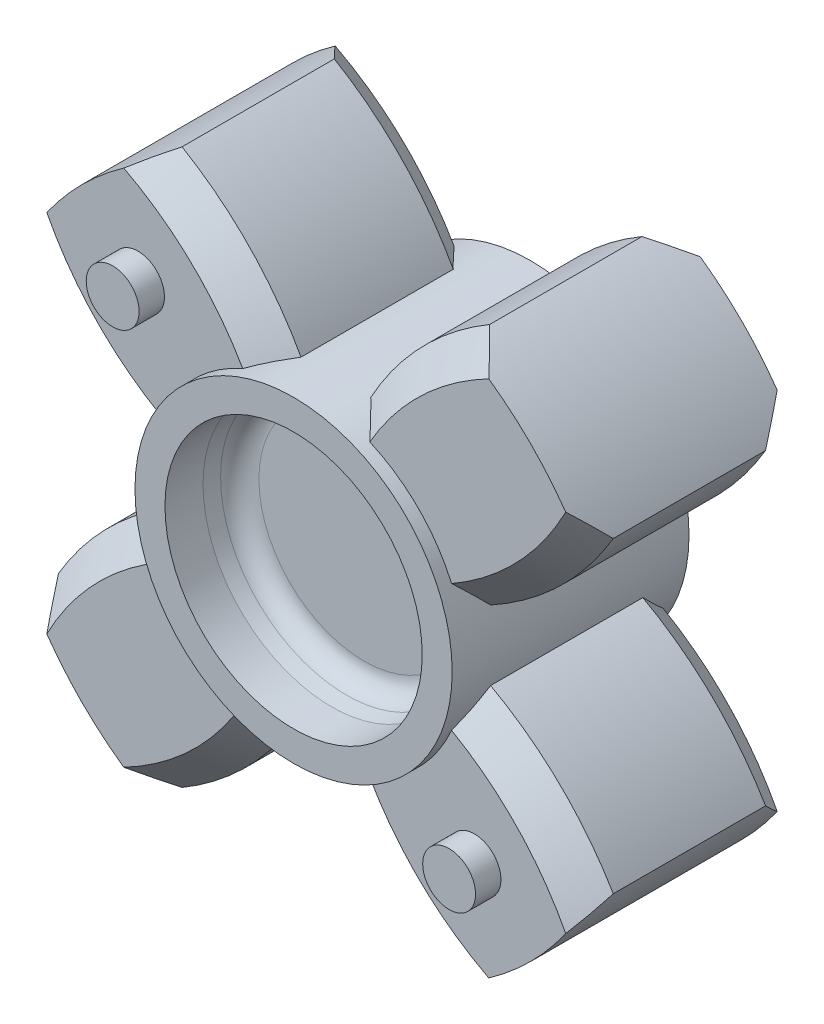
ISO-10303-21;
HEADER;
FILE_DESCRIPTION(('STEP AP214'),'2;1');
FILE_NAME('part.step','',(''),(''),'','','');
FILE_SCHEMA(('AUTOMOTIVE_DESIGN { 1 0 10303 214 1 1 1 1 }'));
ENDSEC;
DATA;
#1=APPLICATION_CONTEXT('core data for automotive mechanical design processes');
#2=APPLICATION_PROTOCOL_DEFINITION('international standard','automotive_design',2000,#1);
#3=PRODUCT_CONTEXT('',#1,'mechanical');
#4=PRODUCT('Part','Part','',(#3));
#5=PRODUCT_RELATED_PRODUCT_CATEGORY('part','',(#4));
#6=PRODUCT_DEFINITION_FORMATION('','',#4);
#7=PRODUCT_DEFINITION_CONTEXT('part definition',#1,'design');
#8=PRODUCT_DEFINITION('design','',#6,#7);
#9=PRODUCT_DEFINITION_SHAPE('','',#8);
#10=(LENGTH_UNIT() NAMED_UNIT(*) SI_UNIT(.MILLI.,.METRE.));
#11=(NAMED_UNIT(*) PLANE_ANGLE_UNIT() SI_UNIT($,.RADIAN.));
#12=(NAMED_UNIT(*) SI_UNIT($,.STERADIAN.) SOLID_ANGLE_UNIT());
#13=UNCERTAINTY_MEASURE_WITH_UNIT(LENGTH_MEASURE(1.E-05),#10,'distance_accuracy_value','');
#14=(GEOMETRIC_REPRESENTATION_CONTEXT(3) GLOBAL_UNCERTAINTY_ASSIGNED_CONTEXT((#13)) GLOBAL_UNIT_ASSIGNED_CONTEXT((#10,
#11,#12)) REPRESENTATION_CONTEXT('',''));
#15=CARTESIAN_POINT('',(0.,0.,0.));
#16=DIRECTION('',(0.,0.,1.));
#17=DIRECTION('',(1.,0.,0.));
#18=AXIS2_PLACEMENT_3D('',#15,#16,#17);
#19=CARTESIAN_POINT('',(0.,0.,-1.43933333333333));
#20=DIRECTION('',(0.,0.,-1.));
#21=DIRECTION('',(0.,-1.,0.));
#22=AXIS2_PLACEMENT_3D('',#19,#20,#21);
#23=PLANE('',#22);
#24=CARTESIAN_POINT('',(0.,0.,-1.43933333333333));
#25=DIRECTION('',(0.,0.,-1.));
#26=DIRECTION('',(-1.,0.,0.));
#27=AXIS2_PLACEMENT_3D('',#24,#25,#26);
#28=CIRCLE('',#27,3.15794629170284);
#29=CARTESIAN_POINT('',(-3.15794629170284,0.,-1.43933333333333));
#30=VERTEX_POINT('',#29);
#31=EDGE_CURVE('E781',#30,#30,#28,.T.);
#32=ORIENTED_EDGE('',*,*,#31,.T.);
#33=EDGE_LOOP('',(#32));
#34=FACE_BOUND('',#33,.T.);
#35=ADVANCED_FACE('F16',(#34),#23,.T.);
#36=CARTESIAN_POINT('',(0.,0.,1.43933333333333));
#37=DIRECTION('',(0.,0.,1.));
#38=DIRECTION('',(1.,0.,0.));
#39=AXIS2_PLACEMENT_3D('',#36,#37,#38);
#40=PLANE('',#39);
#41=CARTESIAN_POINT('',(0.,0.,1.43933333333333));
#42=DIRECTION('',(0.,0.,1.));
#43=DIRECTION('',(1.,0.,0.));
#44=AXIS2_PLACEMENT_3D('',#41,#42,#43);
#45=CIRCLE('',#44,3.15794629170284);
#46=CARTESIAN_POINT('',(3.15794629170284,0.,1.43933333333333));
#47=VERTEX_POINT('',#46);
#48=EDGE_CURVE('E742',#47,#47,#45,.T.);
#49=ORIENTED_EDGE('',*,*,#48,.T.);
#50=EDGE_LOOP('',(#49));
#51=FACE_BOUND('',#50,.T.);
#52=ADVANCED_FACE('F984',(#51),#40,.T.);
#53=CARTESIAN_POINT('',(5.05139406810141,5.0513940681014,-3.937));
#54=DIRECTION('',(0.,0.,-1.));
#55=DIRECTION('',(0.,-1.,0.));
#56=AXIS2_PLACEMENT_3D('',#53,#54,#55);
#57=PLANE('',#56);
#58=CARTESIAN_POINT('',(5.05139406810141,5.0513940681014,-3.937));
#59=DIRECTION('',(0.,0.,-1.));
#60=DIRECTION('',(-1.,0.,0.));
#61=AXIS2_PLACEMENT_3D('',#58,#59,#60);
#62=CIRCLE('',#61,0.79375);
#63=CARTESIAN_POINT('',(5.84514406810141,5.0513940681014,-3.937));
#64=VERTEX_POINT('',#63);
#65=EDGE_CURVE('E698',#64,#64,#62,.T.);
#66=ORIENTED_EDGE('',*,*,#65,.T.);
#67=EDGE_LOOP('',(#66));
#68=FACE_BOUND('',#67,.T.);
#69=ADVANCED_FACE('F990',(#68),#57,.T.);
#70=CARTESIAN_POINT('',(-5.05139406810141,-5.0513940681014,-3.937));
#71=DIRECTION('',(0.,0.,-1.));
#72=DIRECTION('',(0.,-1.,0.));
#73=AXIS2_PLACEMENT_3D('',#70,#71,#72);
#74=PLANE('',#73);
#75=CARTESIAN_POINT('',(-5.05139406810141,-5.0513940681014,-3.937));
#76=DIRECTION('',(0.,0.,-1.));
#77=DIRECTION('',(-1.,0.,0.));
#78=AXIS2_PLACEMENT_3D('',#75,#76,#77);
#79=CIRCLE('',#78,0.79375);
#80=CARTESIAN_POINT('',(-4.25764406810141,-5.0513940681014,-3.937));
#81=VERTEX_POINT('',#80);
#82=EDGE_CURVE('E708',#81,#81,#79,.T.);
#83=ORIENTED_EDGE('',*,*,#82,.T.);
#84=EDGE_LOOP('',(#83));
#85=FACE_BOUND('',#84,.T.);
#86=ADVANCED_FACE('F997',(#85),#74,.T.);
#87=CARTESIAN_POINT('',(-5.0513940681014,5.0513940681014,3.937));
#88=DIRECTION('',(0.,0.,1.));
#89=DIRECTION('',(1.,0.,0.));
#90=AXIS2_PLACEMENT_3D('',#87,#88,#89);
#91=PLANE('',#90);
#92=CARTESIAN_POINT('',(-5.0513940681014,5.0513940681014,3.937));
#93=DIRECTION('',(0.,0.,1.));
#94=DIRECTION('',(1.,0.,0.));
#95=AXIS2_PLACEMENT_3D('',#92,#93,#94);
#96=CIRCLE('',#95,0.79375);
#97=CARTESIAN_POINT('',(-5.8451440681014,5.0513940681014,3.937));
#98=VERTEX_POINT('',#97);
#99=EDGE_CURVE('E787',#98,#98,#96,.T.);
#100=ORIENTED_EDGE('',*,*,#99,.T.);
#101=EDGE_LOOP('',(#100));
#102=FACE_BOUND('',#101,.T.);
#103=ADVANCED_FACE('F1000',(#102),#91,.T.);
#104=CARTESIAN_POINT('',(5.0513940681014,-5.0513940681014,3.937));
#105=DIRECTION('',(0.,0.,1.));
#106=DIRECTION('',(1.,0.,0.));
#107=AXIS2_PLACEMENT_3D('',#104,#105,#106);
#108=PLANE('',#107);
#109=CARTESIAN_POINT('',(5.0513940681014,-5.0513940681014,3.937));
#110=DIRECTION('',(0.,0.,1.));
#111=DIRECTION('',(1.,0.,0.));
#112=AXIS2_PLACEMENT_3D('',#109,#110,#111);
#113=CIRCLE('',#112,0.79375);
#114=CARTESIAN_POINT('',(4.2576440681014,-5.0513940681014,3.937));
#115=VERTEX_POINT('',#114);
#116=EDGE_CURVE('E783',#115,#115,#113,.T.);
#117=ORIENTED_EDGE('',*,*,#116,.T.);
#118=EDGE_LOOP('',(#117));
#119=FACE_BOUND('',#118,.T.);
#120=ADVANCED_FACE('F335',(#119),#108,.T.);
#121=CARTESIAN_POINT('',(-9.525,0.,-3.175));
#122=DIRECTION('',(0.,0.,1.));
#123=DIRECTION('',(1.,0.,0.));
#124=AXIS2_PLACEMENT_3D('',#121,#122,#123);
#125=CONICAL_SURFACE('',#124,8.77824,0.785398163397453);
#126=CARTESIAN_POINT('',(-4.61919794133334,8.32998411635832,-2.286));
#127=CARTESIAN_POINT('',(-4.91754617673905,8.1645420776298,-2.57995845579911));
#128=CARTESIAN_POINT('',(-5.20450656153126,7.98449583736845,-2.87608458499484));
#129=CARTESIAN_POINT('',(-5.47998700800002,7.79072316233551,-3.175));
#130=(BOUNDED_CURVE() B_SPLINE_CURVE(3,(#126,#127,#128,#129),.UNSPECIFIED.,.F.,
.F.) B_SPLINE_CURVE_WITH_KNOTS((4,4),(0.,0.00134984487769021),
.UNSPECIFIED.) CURVE() GEOMETRIC_REPRESENTATION_ITEM() RATIONAL_B_SPLINE_CURVE((1.,1.,1.,1.)) REPRESENTATION_ITEM(''));
#131=CARTESIAN_POINT('',(-4.61919794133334,8.32998411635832,-2.286));
#132=VERTEX_POINT('',#131);
#133=CARTESIAN_POINT('',(-5.47998700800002,7.79072316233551,-3.175));
#134=VERTEX_POINT('',#133);
#135=EDGE_CURVE('E292',#132,#134,#130,.T.);
#136=ORIENTED_EDGE('',*,*,#135,.F.);
#137=CARTESIAN_POINT('',(-9.525,0.,-2.286));
#138=DIRECTION('',(0.,0.,1.));
#139=DIRECTION('',(1.,0.,0.));
#140=AXIS2_PLACEMENT_3D('',#137,#138,#139);
#141=CIRCLE('',#140,9.66724);
#142=CARTESIAN_POINT('',(-1.04732294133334,4.64591443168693,-2.286));
#143=VERTEX_POINT('',#142);
#144=EDGE_CURVE('E367',#143,#132,#141,.T.);
#145=ORIENTED_EDGE('',*,*,#144,.F.);
#146=CARTESIAN_POINT('',(-1.90811200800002,4.36354383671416,-3.175));
#147=CARTESIAN_POINT('',(-1.86952104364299,4.38041909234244,-3.13312645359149));
#148=CARTESIAN_POINT('',(-1.83067637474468,4.39679543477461,-3.09128556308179));
#149=CARTESIAN_POINT('',(-1.75371451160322,4.4280427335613,-3.00897697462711));
#150=CARTESIAN_POINT('',(-1.71561227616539,4.44294467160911,-2.96850704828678));
#151=CARTESIAN_POINT('',(-1.64019675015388,4.47132324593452,-2.88894028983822));
#152=CARTESIAN_POINT('',(-1.60289740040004,4.48483028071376,-2.84984108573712));
#153=CARTESIAN_POINT('',(-1.52914356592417,4.51049884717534,-2.77301599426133));
#154=CARTESIAN_POINT('',(-1.49270208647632,4.5226901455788,-2.73528756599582));
#155=CARTESIAN_POINT('',(-1.42071486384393,4.54580633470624,-2.66120417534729));
#156=CARTESIAN_POINT('',(-1.38518126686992,4.55676031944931,-2.62484648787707));
#157=CARTESIAN_POINT('',(-1.31505579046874,4.57748002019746,-2.55350481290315));
#158=CARTESIAN_POINT('',(-1.28047527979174,4.587274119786,-2.51851789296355));
#159=CARTESIAN_POINT('',(-1.21229751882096,4.60575098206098,-2.44991784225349));
#160=CARTESIAN_POINT('',(-1.17871093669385,4.61446138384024,-2.41630155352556));
#161=CARTESIAN_POINT('',(-1.11255780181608,4.63084630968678,-2.3504434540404));
#162=CARTESIAN_POINT('',(-1.08000131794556,4.63854769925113,-2.31819821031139));
#163=CARTESIAN_POINT('',(-1.04732294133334,4.64591443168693,-2.286));
#164=B_SPLINE_CURVE_WITH_KNOTS('',3,(#146,#147,#148,#149,#150,#151,#152,#153,#154,#155,#156,
#157,#158,#159,#160,#161,#162,#163),.UNSPECIFIED.,.F.,.F.,(4,2,2,2,2,2,2,2,4),(0.,
0.178173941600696,0.350805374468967,0.51789481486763,0.6794428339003,0.835450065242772,
0.98591721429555,1.13084506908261,1.27023451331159),.UNSPECIFIED.);
#165=CARTESIAN_POINT('',(-1.90811200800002,4.36354383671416,-3.175));
#166=VERTEX_POINT('',#165);
#167=EDGE_CURVE('E363',#166,#143,#164,.T.);
#168=ORIENTED_EDGE('',*,*,#167,.F.);
#169=CARTESIAN_POINT('',(-9.525,0.,-3.175));
#170=DIRECTION('',(0.,0.,-1.));
#171=DIRECTION('',(1.,0.,0.));
#172=AXIS2_PLACEMENT_3D('',#169,#170,#171);
#173=CIRCLE('',#172,8.77824);
#174=EDGE_CURVE('E346',#134,#166,#173,.T.);
#175=ORIENTED_EDGE('',*,*,#174,.F.);
#176=EDGE_LOOP('',(#136,#145,#168,#175));
#177=FACE_BOUND('',#176,.T.);
#178=ADVANCED_FACE('F330',(#177),#125,.T.);
#179=CARTESIAN_POINT('',(0.,9.525,-3.175));
#180=DIRECTION('',(0.,0.,1.));
#181=DIRECTION('',(1.,0.,0.));
#182=AXIS2_PLACEMENT_3D('',#179,#180,#181);
#183=CONICAL_SURFACE('',#182,8.77824,0.785398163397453);
#184=CARTESIAN_POINT('',(-4.64591443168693,1.04732294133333,-2.286));
#185=CARTESIAN_POINT('',(-4.63854769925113,1.08000131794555,-2.31819821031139));
#186=CARTESIAN_POINT('',(-4.63084630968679,1.11255780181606,-2.35044345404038));
#187=CARTESIAN_POINT('',(-4.61446138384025,1.17871093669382,-2.41630155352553));
#188=CARTESIAN_POINT('',(-4.60575098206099,1.21229751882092,-2.44991784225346));
#189=CARTESIAN_POINT('',(-4.58727411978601,1.2804752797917,-2.5185178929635));
#190=CARTESIAN_POINT('',(-4.57748002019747,1.3150557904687,-2.5535048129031));
#191=CARTESIAN_POINT('',(-4.55676031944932,1.38518126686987,-2.62484648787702));
#192=CARTESIAN_POINT('',(-4.54580633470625,1.42071486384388,-2.66120417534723));
#193=CARTESIAN_POINT('',(-4.52269014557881,1.49270208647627,-2.73528756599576));
#194=CARTESIAN_POINT('',(-4.51049884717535,1.52914356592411,-2.77301599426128));
#195=CARTESIAN_POINT('',(-4.48483028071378,1.60289740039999,-2.84984108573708));
#196=CARTESIAN_POINT('',(-4.47132324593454,1.64019675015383,-2.88894028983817));
#197=CARTESIAN_POINT('',(-4.44294467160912,1.71561227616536,-2.96850704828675));
#198=CARTESIAN_POINT('',(-4.42804273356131,1.75371451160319,-3.00897697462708));
#199=CARTESIAN_POINT('',(-4.39679543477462,1.83067637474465,-3.09128556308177));
#200=CARTESIAN_POINT('',(-4.38041909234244,1.86952104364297,-3.13312645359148));
#201=CARTESIAN_POINT('',(-4.36354383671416,1.90811200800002,-3.175));
#202=B_SPLINE_CURVE_WITH_KNOTS('',3,(#184,#185,#186,#187,#188,#189,#190,#191,#192,#193,#194,
#195,#196,#197,#198,#199,#200,#201),.UNSPECIFIED.,.F.,.F.,(4,2,2,2,2,2,2,2,4),(0.,
0.139389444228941,0.284317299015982,0.434784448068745,0.590791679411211,0.752339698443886,
0.919429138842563,1.09206057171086,1.27023451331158),.UNSPECIFIED.);
#203=CARTESIAN_POINT('',(-4.64591443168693,1.04732294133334,-2.286));
#204=VERTEX_POINT('',#203);
#205=CARTESIAN_POINT('',(-4.36354383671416,1.90811200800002,-3.175));
#206=VERTEX_POINT('',#205);
#207=EDGE_CURVE('E364',#204,#206,#202,.T.);
#208=ORIENTED_EDGE('',*,*,#207,.F.);
#209=CARTESIAN_POINT('',(0.,9.525,-2.286));
#210=DIRECTION('',(0.,0.,1.));
#211=DIRECTION('',(1.,0.,0.));
#212=AXIS2_PLACEMENT_3D('',#209,#210,#211);
#213=CIRCLE('',#212,9.66724);
#214=CARTESIAN_POINT('',(-8.32998411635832,4.61919794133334,-2.286));
#215=VERTEX_POINT('',#214);
#216=EDGE_CURVE('E548',#215,#204,#213,.T.);
#217=ORIENTED_EDGE('',*,*,#216,.F.);
#218=CARTESIAN_POINT('',(-7.79072316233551,5.47998700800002,-3.175));
#219=CARTESIAN_POINT('',(-7.98449583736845,5.20450656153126,-2.87608458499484));
#220=CARTESIAN_POINT('',(-8.1645420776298,4.91754617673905,-2.57995845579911));
#221=CARTESIAN_POINT('',(-8.32998411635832,4.61919794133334,-2.286));
#222=(BOUNDED_CURVE() B_SPLINE_CURVE(3,(#218,#219,#220,#221),.UNSPECIFIED.,.F.,
.F.) B_SPLINE_CURVE_WITH_KNOTS((4,4),(0.,0.00134984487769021),
.UNSPECIFIED.) CURVE() GEOMETRIC_REPRESENTATION_ITEM() RATIONAL_B_SPLINE_CURVE((1.,1.,1.,1.)) REPRESENTATION_ITEM(''));
#223=CARTESIAN_POINT('',(-7.79072316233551,5.47998700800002,-3.175));
#224=VERTEX_POINT('',#223);
#225=EDGE_CURVE('E285',#224,#215,#222,.T.);
#226=ORIENTED_EDGE('',*,*,#225,.F.);
#227=CARTESIAN_POINT('',(0.,9.525,-3.175));
#228=DIRECTION('',(0.,0.,-1.));
#229=DIRECTION('',(1.,0.,0.));
#230=AXIS2_PLACEMENT_3D('',#227,#228,#229);
#231=CIRCLE('',#230,8.77824);
#232=EDGE_CURVE('E876',#206,#224,#231,.T.);
#233=ORIENTED_EDGE('',*,*,#232,.F.);
#234=EDGE_LOOP('',(#208,#217,#226,#233));
#235=FACE_BOUND('',#234,.T.);
#236=ADVANCED_FACE('F334',(#235),#183,.T.);
#237=CARTESIAN_POINT('',(0.,-9.525,-3.175));
#238=DIRECTION('',(0.,0.,1.));
#239=DIRECTION('',(1.,0.,0.));
#240=AXIS2_PLACEMENT_3D('',#237,#238,#239);
#241=CONICAL_SURFACE('',#240,8.77824,0.785398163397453);
#242=CARTESIAN_POINT('',(-8.32998411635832,-4.61919794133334,-2.286));
#243=CARTESIAN_POINT('',(-8.1645420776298,-4.91754617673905,-2.57995845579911));
#244=CARTESIAN_POINT('',(-7.98449583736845,-5.20450656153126,-2.87608458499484));
#245=CARTESIAN_POINT('',(-7.79072316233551,-5.47998700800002,-3.175));
#246=(BOUNDED_CURVE() B_SPLINE_CURVE(3,(#242,#243,#244,#245),.UNSPECIFIED.,.F.,
.F.) B_SPLINE_CURVE_WITH_KNOTS((4,4),(0.,0.00134984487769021),
.UNSPECIFIED.) CURVE() GEOMETRIC_REPRESENTATION_ITEM() RATIONAL_B_SPLINE_CURVE((1.,1.,1.,1.)) REPRESENTATION_ITEM(''));
#247=CARTESIAN_POINT('',(-8.32998411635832,-4.61919794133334,-2.286));
#248=VERTEX_POINT('',#247);
#249=CARTESIAN_POINT('',(-7.79072316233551,-5.47998700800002,-3.175));
#250=VERTEX_POINT('',#249);
#251=EDGE_CURVE('E747',#248,#250,#246,.T.);
#252=ORIENTED_EDGE('',*,*,#251,.F.);
#253=CARTESIAN_POINT('',(0.,-9.525,-2.286));
#254=DIRECTION('',(0.,0.,1.));
#255=DIRECTION('',(1.,0.,0.));
#256=AXIS2_PLACEMENT_3D('',#253,#254,#255);
#257=CIRCLE('',#256,9.66724);
#258=CARTESIAN_POINT('',(-4.64591443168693,-1.04732294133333,-2.286));
#259=VERTEX_POINT('',#258);
#260=EDGE_CURVE('E42',#259,#248,#257,.T.);
#261=ORIENTED_EDGE('',*,*,#260,.F.);
#262=CARTESIAN_POINT('',(-4.36354383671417,-1.908112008,-3.175));
#263=CARTESIAN_POINT('',(-4.38041909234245,-1.86952104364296,-3.13312645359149));
#264=CARTESIAN_POINT('',(-4.39679543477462,-1.83067637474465,-3.09128556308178));
#265=CARTESIAN_POINT('',(-4.42804273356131,-1.75371451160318,-3.00897697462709));
#266=CARTESIAN_POINT('',(-4.44294467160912,-1.71561227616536,-2.96850704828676));
#267=CARTESIAN_POINT('',(-4.47132324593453,-1.64019675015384,-2.88894028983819));
#268=CARTESIAN_POINT('',(-4.48483028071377,-1.60289740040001,-2.8498410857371));
#269=CARTESIAN_POINT('',(-4.51049884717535,-1.52914356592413,-2.7730159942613));
#270=CARTESIAN_POINT('',(-4.52269014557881,-1.49270208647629,-2.73528756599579));
#271=CARTESIAN_POINT('',(-4.54580633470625,-1.4207148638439,-2.66120417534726));
#272=CARTESIAN_POINT('',(-4.55676031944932,-1.38518126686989,-2.62484648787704));
#273=CARTESIAN_POINT('',(-4.57748002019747,-1.31505579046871,-2.55350481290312));
#274=CARTESIAN_POINT('',(-4.58727411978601,-1.28047527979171,-2.51851789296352));
#275=CARTESIAN_POINT('',(-4.60575098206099,-1.21229751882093,-2.44991784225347));
#276=CARTESIAN_POINT('',(-4.61446138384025,-1.17871093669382,-2.41630155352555));
#277=CARTESIAN_POINT('',(-4.63084630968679,-1.11255780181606,-2.35044345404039));
#278=CARTESIAN_POINT('',(-4.63854769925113,-1.08000131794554,-2.31819821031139));
#279=CARTESIAN_POINT('',(-4.64591443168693,-1.04732294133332,-2.286));
#280=B_SPLINE_CURVE_WITH_KNOTS('',3,(#262,#263,#264,#265,#266,#267,#268,#269,#270,#271,#272,
#273,#274,#275,#276,#277,#278,#279),.UNSPECIFIED.,.F.,.F.,(4,2,2,2,2,2,2,2,4),(0.,
0.178173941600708,0.350805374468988,0.517894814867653,0.679442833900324,0.835450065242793,
0.985917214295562,1.13084506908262,1.27023451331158),.UNSPECIFIED.);
#281=CARTESIAN_POINT('',(-4.36354383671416,-1.90811200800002,-3.175));
#282=VERTEX_POINT('',#281);
#283=EDGE_CURVE('E2136',#282,#259,#280,.T.);
#284=ORIENTED_EDGE('',*,*,#283,.F.);
#285=CARTESIAN_POINT('',(0.,-9.525,-3.175));
#286=DIRECTION('',(0.,0.,-1.));
#287=DIRECTION('',(1.,0.,0.));
#288=AXIS2_PLACEMENT_3D('',#285,#286,#287);
#289=CIRCLE('',#288,8.77824);
#290=EDGE_CURVE('E746',#250,#282,#289,.T.);
#291=ORIENTED_EDGE('',*,*,#290,.F.);
#292=EDGE_LOOP('',(#252,#261,#284,#291));
#293=FACE_BOUND('',#292,.T.);
#294=ADVANCED_FACE('F1496',(#293),#241,.T.);
#295=CARTESIAN_POINT('',(-9.525,0.,-3.175));
#296=DIRECTION('',(0.,0.,1.));
#297=DIRECTION('',(1.,0.,0.));
#298=AXIS2_PLACEMENT_3D('',#295,#296,#297);
#299=CONICAL_SURFACE('',#298,8.77824,0.785398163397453);
#300=CARTESIAN_POINT('',(-1.04732294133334,-4.64591443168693,-2.286));
#301=CARTESIAN_POINT('',(-1.08000131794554,-4.63854769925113,-2.31819821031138));
#302=CARTESIAN_POINT('',(-1.11255780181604,-4.63084630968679,-2.35044345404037));
#303=CARTESIAN_POINT('',(-1.17871093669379,-4.61446138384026,-2.41630155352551));
#304=CARTESIAN_POINT('',(-1.21229751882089,-4.605750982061,-2.44991784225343));
#305=CARTESIAN_POINT('',(-1.28047527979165,-4.58727411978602,-2.51851789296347));
#306=CARTESIAN_POINT('',(-1.31505579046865,-4.57748002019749,-2.55350481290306));
#307=CARTESIAN_POINT('',(-1.38518126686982,-4.55676031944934,-2.62484648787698));
#308=CARTESIAN_POINT('',(-1.42071486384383,-4.54580633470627,-2.66120417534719));
#309=CARTESIAN_POINT('',(-1.49270208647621,-4.52269014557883,-2.73528756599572));
#310=CARTESIAN_POINT('',(-1.52914356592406,-4.51049884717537,-2.77301599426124));
#311=CARTESIAN_POINT('',(-1.60289740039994,-4.4848302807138,-2.84984108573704));
#312=CARTESIAN_POINT('',(-1.64019675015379,-4.47132324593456,-2.88894028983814));
#313=CARTESIAN_POINT('',(-1.71561227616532,-4.44294467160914,-2.96850704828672));
#314=CARTESIAN_POINT('',(-1.75371451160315,-4.42804273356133,-3.00897697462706));
#315=CARTESIAN_POINT('',(-1.83067637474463,-4.39679543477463,-3.09128556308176));
#316=CARTESIAN_POINT('',(-1.86952104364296,-4.38041909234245,-3.13312645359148));
#317=CARTESIAN_POINT('',(-1.90811200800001,-4.36354383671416,-3.175));
#318=B_SPLINE_CURVE_WITH_KNOTS('',3,(#300,#301,#302,#303,#304,#305,#306,#307,#308,#309,#310,
#311,#312,#313,#314,#315,#316,#317),.UNSPECIFIED.,.F.,.F.,(4,2,2,2,2,2,2,2,4),(0.,
0.139389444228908,0.28431729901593,0.434784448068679,0.590791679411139,0.752339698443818,
0.919429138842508,1.09206057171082,1.27023451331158),.UNSPECIFIED.);
#319=CARTESIAN_POINT('',(-1.04732294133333,-4.64591443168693,-2.286));
#320=VERTEX_POINT('',#319);
#321=CARTESIAN_POINT('',(-1.90811200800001,-4.36354383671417,-3.175));
#322=VERTEX_POINT('',#321);
#323=EDGE_CURVE('E1153',#320,#322,#318,.T.);
#324=ORIENTED_EDGE('',*,*,#323,.F.);
#325=CARTESIAN_POINT('',(-9.525,0.,-2.286));
#326=DIRECTION('',(0.,0.,1.));
#327=DIRECTION('',(1.,0.,0.));
#328=AXIS2_PLACEMENT_3D('',#325,#326,#327);
#329=CIRCLE('',#328,9.66724);
#330=CARTESIAN_POINT('',(-4.61919794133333,-8.32998411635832,-2.286));
#331=VERTEX_POINT('',#330);
#332=EDGE_CURVE('E1081',#331,#320,#329,.T.);
#333=ORIENTED_EDGE('',*,*,#332,.F.);
#334=CARTESIAN_POINT('',(-5.47998700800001,-7.79072316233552,-3.175));
#335=CARTESIAN_POINT('',(-5.20450656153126,-7.98449583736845,-2.87608458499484));
#336=CARTESIAN_POINT('',(-4.91754617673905,-8.1645420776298,-2.57995845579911));
#337=CARTESIAN_POINT('',(-4.61919794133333,-8.32998411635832,-2.286));
#338=(BOUNDED_CURVE() B_SPLINE_CURVE(3,(#334,#335,#336,#337),.UNSPECIFIED.,.F.,
.F.) B_SPLINE_CURVE_WITH_KNOTS((4,4),(0.,0.00134984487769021),
.UNSPECIFIED.) CURVE() GEOMETRIC_REPRESENTATION_ITEM() RATIONAL_B_SPLINE_CURVE((1.,1.,1.,1.)) REPRESENTATION_ITEM(''));
#339=CARTESIAN_POINT('',(-5.47998700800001,-7.79072316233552,-3.175));
#340=VERTEX_POINT('',#339);
#341=EDGE_CURVE('E549',#340,#331,#338,.T.);
#342=ORIENTED_EDGE('',*,*,#341,.F.);
#343=CARTESIAN_POINT('',(-9.525,0.,-3.175));
#344=DIRECTION('',(0.,0.,-1.));
#345=DIRECTION('',(1.,0.,0.));
#346=AXIS2_PLACEMENT_3D('',#343,#344,#345);
#347=CIRCLE('',#346,8.77824);
#348=EDGE_CURVE('E816',#322,#340,#347,.T.);
#349=ORIENTED_EDGE('',*,*,#348,.F.);
#350=EDGE_LOOP('',(#324,#333,#342,#349));
#351=FACE_BOUND('',#350,.T.);
#352=ADVANCED_FACE('F507',(#351),#299,.T.);
#353=CARTESIAN_POINT('',(9.525,0.,-3.175));
#354=DIRECTION('',(0.,0.,1.));
#355=DIRECTION('',(1.,0.,0.));
#356=AXIS2_PLACEMENT_3D('',#353,#354,#355);
#357=CONICAL_SURFACE('',#356,8.77824,0.785398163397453);
#358=CARTESIAN_POINT('',(4.61919794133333,-8.32998411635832,-2.286));
#359=CARTESIAN_POINT('',(4.91754617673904,-8.1645420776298,-2.57995845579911));
#360=CARTESIAN_POINT('',(5.20450656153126,-7.98449583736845,-2.87608458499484));
#361=CARTESIAN_POINT('',(5.47998700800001,-7.79072316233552,-3.175));
#362=(BOUNDED_CURVE() B_SPLINE_CURVE(3,(#358,#359,#360,#361),.UNSPECIFIED.,.F.,
.F.) B_SPLINE_CURVE_WITH_KNOTS((4,4),(0.,0.00134984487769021),
.UNSPECIFIED.) CURVE() GEOMETRIC_REPRESENTATION_ITEM() RATIONAL_B_SPLINE_CURVE((1.,1.,1.,1.)) REPRESENTATION_ITEM(''));
#363=CARTESIAN_POINT('',(4.61919794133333,-8.32998411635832,-2.286));
#364=VERTEX_POINT('',#363);
#365=CARTESIAN_POINT('',(5.47998700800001,-7.79072316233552,-3.175));
#366=VERTEX_POINT('',#365);
#367=EDGE_CURVE('E268',#364,#366,#362,.T.);
#368=ORIENTED_EDGE('',*,*,#367,.F.);
#369=CARTESIAN_POINT('',(9.525,0.,-2.286));
#370=DIRECTION('',(0.,0.,1.));
#371=DIRECTION('',(1.,0.,0.));
#372=AXIS2_PLACEMENT_3D('',#369,#370,#371);
#373=CIRCLE('',#372,9.66724);
#374=CARTESIAN_POINT('',(1.04732294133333,-4.64591443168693,-2.286));
#375=VERTEX_POINT('',#374);
#376=EDGE_CURVE('E1034',#375,#364,#373,.T.);
#377=ORIENTED_EDGE('',*,*,#376,.F.);
#378=CARTESIAN_POINT('',(1.90811200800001,-4.36354383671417,-3.175));
#379=CARTESIAN_POINT('',(1.86952104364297,-4.38041909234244,-3.13312645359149));
#380=CARTESIAN_POINT('',(1.83067637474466,-4.39679543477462,-3.09128556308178));
#381=CARTESIAN_POINT('',(1.7537145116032,-4.4280427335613,-3.0089769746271));
#382=CARTESIAN_POINT('',(1.71561227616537,-4.44294467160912,-2.96850704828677));
#383=CARTESIAN_POINT('',(1.64019675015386,-4.47132324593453,-2.8889402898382));
#384=CARTESIAN_POINT('',(1.60289740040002,-4.48483028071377,-2.84984108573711));
#385=CARTESIAN_POINT('',(1.52914356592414,-4.51049884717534,-2.77301599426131));
#386=CARTESIAN_POINT('',(1.4927020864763,-4.5226901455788,-2.7352875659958));
#387=CARTESIAN_POINT('',(1.42071486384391,-4.54580633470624,-2.66120417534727));
#388=CARTESIAN_POINT('',(1.3851812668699,-4.55676031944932,-2.62484648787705));
#389=CARTESIAN_POINT('',(1.31505579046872,-4.57748002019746,-2.55350481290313));
#390=CARTESIAN_POINT('',(1.28047527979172,-4.587274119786,-2.51851789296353));
#391=CARTESIAN_POINT('',(1.21229751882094,-4.60575098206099,-2.44991784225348));
#392=CARTESIAN_POINT('',(1.17871093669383,-4.61446138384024,-2.41630155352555));
#393=CARTESIAN_POINT('',(1.11255780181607,-4.63084630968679,-2.35044345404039));
#394=CARTESIAN_POINT('',(1.08000131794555,-4.63854769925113,-2.31819821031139));
#395=CARTESIAN_POINT('',(1.04732294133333,-4.64591443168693,-2.286));
#396=B_SPLINE_CURVE_WITH_KNOTS('',3,(#378,#379,#380,#381,#382,#383,#384,#385,#386,#387,#388,
#389,#390,#391,#392,#393,#394,#395),.UNSPECIFIED.,.F.,.F.,(4,2,2,2,2,2,2,2,4),(0.,
0.178173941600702,0.35080537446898,0.517894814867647,0.679442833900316,0.835450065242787,
0.98591721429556,1.13084506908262,1.27023451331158),.UNSPECIFIED.);
#397=CARTESIAN_POINT('',(1.90811200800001,-4.36354383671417,-3.175));
#398=VERTEX_POINT('',#397);
#399=EDGE_CURVE('E492',#398,#375,#396,.T.);
#400=ORIENTED_EDGE('',*,*,#399,.F.);
#401=CARTESIAN_POINT('',(9.525,0.,-3.175));
#402=DIRECTION('',(0.,0.,-1.));
#403=DIRECTION('',(1.,0.,0.));
#404=AXIS2_PLACEMENT_3D('',#401,#402,#403);
#405=CIRCLE('',#404,8.77824);
#406=EDGE_CURVE('E278',#366,#398,#405,.T.);
#407=ORIENTED_EDGE('',*,*,#406,.F.);
#408=EDGE_LOOP('',(#368,#377,#400,#407));
#409=FACE_BOUND('',#408,.T.);
#410=ADVANCED_FACE('F316',(#409),#357,.T.);
#411=CARTESIAN_POINT('',(0.,-9.525,-3.175));
#412=DIRECTION('',(0.,0.,1.));
#413=DIRECTION('',(1.,0.,0.));
#414=AXIS2_PLACEMENT_3D('',#411,#412,#413);
#415=CONICAL_SURFACE('',#414,8.77824,0.785398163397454);
#416=CARTESIAN_POINT('',(4.64591443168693,-1.04732294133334,-2.286));
#417=CARTESIAN_POINT('',(4.63854769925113,-1.08000131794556,-2.31819821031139));
#418=CARTESIAN_POINT('',(4.63084630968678,-1.11255780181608,-2.35044345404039));
#419=CARTESIAN_POINT('',(4.61446138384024,-1.17871093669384,-2.41630155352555));
#420=CARTESIAN_POINT('',(4.60575098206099,-1.21229751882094,-2.44991784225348));
#421=CARTESIAN_POINT('',(4.587274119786,-1.28047527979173,-2.51851789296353));
#422=CARTESIAN_POINT('',(4.57748002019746,-1.31505579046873,-2.55350481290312));
#423=CARTESIAN_POINT('',(4.55676031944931,-1.3851812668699,-2.62484648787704));
#424=CARTESIAN_POINT('',(4.54580633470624,-1.42071486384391,-2.66120417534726));
#425=CARTESIAN_POINT('',(4.5226901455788,-1.4927020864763,-2.73528756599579));
#426=CARTESIAN_POINT('',(4.51049884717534,-1.52914356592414,-2.77301599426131));
#427=CARTESIAN_POINT('',(4.48483028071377,-1.60289740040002,-2.8498410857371));
#428=CARTESIAN_POINT('',(4.47132324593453,-1.64019675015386,-2.88894028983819));
#429=CARTESIAN_POINT('',(4.44294467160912,-1.71561227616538,-2.96850704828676));
#430=CARTESIAN_POINT('',(4.4280427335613,-1.7537145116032,-3.00897697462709));
#431=CARTESIAN_POINT('',(4.39679543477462,-1.83067637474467,-3.09128556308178));
#432=CARTESIAN_POINT('',(4.38041909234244,-1.86952104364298,-3.13312645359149));
#433=CARTESIAN_POINT('',(4.36354383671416,-1.90811200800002,-3.175));
#434=B_SPLINE_CURVE_WITH_KNOTS('',3,(#416,#417,#418,#419,#420,#421,#422,#423,#424,#425,#426,
#427,#428,#429,#430,#431,#432,#433),.UNSPECIFIED.,.F.,.F.,(4,2,2,2,2,2,2,2,4),(0.,
0.139389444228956,0.284317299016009,0.43478444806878,0.590791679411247,0.752339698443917,
0.919429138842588,1.09206057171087,1.27023451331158),.UNSPECIFIED.);
#435=CARTESIAN_POINT('',(4.64591443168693,-1.04732294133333,-2.286));
#436=VERTEX_POINT('',#435);
#437=CARTESIAN_POINT('',(4.36354383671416,-1.90811200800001,-3.175));
#438=VERTEX_POINT('',#437);
#439=EDGE_CURVE('E1087',#436,#438,#434,.T.);
#440=ORIENTED_EDGE('',*,*,#439,.F.);
#441=CARTESIAN_POINT('',(0.,-9.525,-2.286));
#442=DIRECTION('',(0.,0.,1.));
#443=DIRECTION('',(1.,0.,0.));
#444=AXIS2_PLACEMENT_3D('',#441,#442,#443);
#445=CIRCLE('',#444,9.66724);
#446=CARTESIAN_POINT('',(8.32998411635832,-4.61919794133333,-2.286));
#447=VERTEX_POINT('',#446);
#448=EDGE_CURVE('E262',#447,#436,#445,.T.);
#449=ORIENTED_EDGE('',*,*,#448,.F.);
#450=CARTESIAN_POINT('',(7.79072316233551,-5.47998700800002,-3.175));
#451=CARTESIAN_POINT('',(7.98449583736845,-5.20450656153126,-2.87608458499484));
#452=CARTESIAN_POINT('',(8.1645420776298,-4.91754617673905,-2.57995845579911));
#453=CARTESIAN_POINT('',(8.32998411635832,-4.61919794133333,-2.286));
#454=(BOUNDED_CURVE() B_SPLINE_CURVE(3,(#450,#451,#452,#453),.UNSPECIFIED.,.F.,
.F.) B_SPLINE_CURVE_WITH_KNOTS((4,4),(0.,0.00134984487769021),
.UNSPECIFIED.) CURVE() GEOMETRIC_REPRESENTATION_ITEM() RATIONAL_B_SPLINE_CURVE((1.,1.,1.,1.)) REPRESENTATION_ITEM(''));
#455=CARTESIAN_POINT('',(7.79072316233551,-5.47998700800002,-3.175));
#456=VERTEX_POINT('',#455);
#457=EDGE_CURVE('E254',#456,#447,#454,.T.);
#458=ORIENTED_EDGE('',*,*,#457,.F.);
#459=CARTESIAN_POINT('',(0.,-9.525,-3.175));
#460=DIRECTION('',(0.,0.,-1.));
#461=DIRECTION('',(1.,0.,0.));
#462=AXIS2_PLACEMENT_3D('',#459,#460,#461);
#463=CIRCLE('',#462,8.77824);
#464=EDGE_CURVE('E259',#438,#456,#463,.T.);
#465=ORIENTED_EDGE('',*,*,#464,.F.);
#466=EDGE_LOOP('',(#440,#449,#458,#465));
#467=FACE_BOUND('',#466,.T.);
#468=ADVANCED_FACE('F257',(#467),#415,.T.);
#469=CARTESIAN_POINT('',(9.525,0.,-3.175));
#470=DIRECTION('',(0.,0.,1.));
#471=DIRECTION('',(1.,0.,0.));
#472=AXIS2_PLACEMENT_3D('',#469,#470,#471);
#473=CONICAL_SURFACE('',#472,8.77824,0.785398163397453);
#474=CARTESIAN_POINT('',(1.04732294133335,4.64591443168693,-2.286));
#475=CARTESIAN_POINT('',(1.08000131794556,4.63854769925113,-2.31819821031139));
#476=CARTESIAN_POINT('',(1.11255780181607,4.63084630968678,-2.35044345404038));
#477=CARTESIAN_POINT('',(1.17871093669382,4.61446138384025,-2.41630155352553));
#478=CARTESIAN_POINT('',(1.21229751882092,4.60575098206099,-2.44991784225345));
#479=CARTESIAN_POINT('',(1.28047527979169,4.58727411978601,-2.5185178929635));
#480=CARTESIAN_POINT('',(1.31505579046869,4.57748002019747,-2.55350481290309));
#481=CARTESIAN_POINT('',(1.38518126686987,4.55676031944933,-2.62484648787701));
#482=CARTESIAN_POINT('',(1.42071486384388,4.54580633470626,-2.66120417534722));
#483=CARTESIAN_POINT('',(1.49270208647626,4.52269014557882,-2.73528756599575));
#484=CARTESIAN_POINT('',(1.52914356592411,4.51049884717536,-2.77301599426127));
#485=CARTESIAN_POINT('',(1.60289740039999,4.48483028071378,-2.84984108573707));
#486=CARTESIAN_POINT('',(1.64019675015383,4.47132324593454,-2.88894028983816));
#487=CARTESIAN_POINT('',(1.71561227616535,4.44294467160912,-2.96850704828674));
#488=CARTESIAN_POINT('',(1.75371451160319,4.42804273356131,-3.00897697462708));
#489=CARTESIAN_POINT('',(1.83067637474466,4.39679543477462,-3.09128556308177));
#490=CARTESIAN_POINT('',(1.86952104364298,4.38041909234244,-3.13312645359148));
#491=CARTESIAN_POINT('',(1.90811200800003,4.36354383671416,-3.175));
#492=B_SPLINE_CURVE_WITH_KNOTS('',3,(#474,#475,#476,#477,#478,#479,#480,#481,#482,#483,#484,
#485,#486,#487,#488,#489,#490,#491),.UNSPECIFIED.,.F.,.F.,(4,2,2,2,2,2,2,2,4),(0.,
0.139389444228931,0.284317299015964,0.434784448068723,0.590791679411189,0.752339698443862,
0.919429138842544,1.09206057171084,1.27023451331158),.UNSPECIFIED.);
#493=CARTESIAN_POINT('',(1.04732294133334,4.64591443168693,-2.286));
#494=VERTEX_POINT('',#493);
#495=CARTESIAN_POINT('',(1.90811200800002,4.36354383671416,-3.175));
#496=VERTEX_POINT('',#495);
#497=EDGE_CURVE('E905',#494,#496,#492,.T.);
#498=ORIENTED_EDGE('',*,*,#497,.F.);
#499=CARTESIAN_POINT('',(9.525,0.,-2.286));
#500=DIRECTION('',(0.,0.,1.));
#501=DIRECTION('',(1.,0.,0.));
#502=AXIS2_PLACEMENT_3D('',#499,#500,#501);
#503=CIRCLE('',#502,9.66724);
#504=CARTESIAN_POINT('',(4.61919794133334,8.32998411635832,-2.286));
#505=VERTEX_POINT('',#504);
#506=EDGE_CURVE('E11',#505,#494,#503,.T.);
#507=ORIENTED_EDGE('',*,*,#506,.F.);
#508=CARTESIAN_POINT('',(5.47998700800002,7.79072316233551,-3.175));
#509=CARTESIAN_POINT('',(5.20450656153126,7.98449583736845,-2.87608458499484));
#510=CARTESIAN_POINT('',(4.91754617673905,8.1645420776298,-2.57995845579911));
#511=CARTESIAN_POINT('',(4.61919794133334,8.32998411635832,-2.286));
#512=(BOUNDED_CURVE() B_SPLINE_CURVE(3,(#508,#509,#510,#511),.UNSPECIFIED.,.F.,
.F.) B_SPLINE_CURVE_WITH_KNOTS((4,4),(0.,0.00134984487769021),
.UNSPECIFIED.) CURVE() GEOMETRIC_REPRESENTATION_ITEM() RATIONAL_B_SPLINE_CURVE((1.,1.,1.,1.)) REPRESENTATION_ITEM(''));
#513=CARTESIAN_POINT('',(5.47998700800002,7.79072316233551,-3.175));
#514=VERTEX_POINT('',#513);
#515=EDGE_CURVE('E822',#514,#505,#512,.T.);
#516=ORIENTED_EDGE('',*,*,#515,.F.);
#517=CARTESIAN_POINT('',(9.525,0.,-3.175));
#518=DIRECTION('',(0.,0.,-1.));
#519=DIRECTION('',(1.,0.,0.));
#520=AXIS2_PLACEMENT_3D('',#517,#518,#519);
#521=CIRCLE('',#520,8.77824);
#522=EDGE_CURVE('E1171',#496,#514,#521,.T.);
#523=ORIENTED_EDGE('',*,*,#522,.F.);
#524=EDGE_LOOP('',(#498,#507,#516,#523));
#525=FACE_BOUND('',#524,.T.);
#526=ADVANCED_FACE('F315',(#525),#473,.T.);
#527=CARTESIAN_POINT('',(0.,9.525,-3.175));
#528=DIRECTION('',(0.,0.,1.));
#529=DIRECTION('',(1.,0.,0.));
#530=AXIS2_PLACEMENT_3D('',#527,#528,#529);
#531=CONICAL_SURFACE('',#530,8.77824,0.785398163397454);
#532=CARTESIAN_POINT('',(8.32998411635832,4.61919794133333,-2.286));
#533=CARTESIAN_POINT('',(8.1645420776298,4.91754617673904,-2.57995845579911));
#534=CARTESIAN_POINT('',(7.98449583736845,5.20450656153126,-2.87608458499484));
#535=CARTESIAN_POINT('',(7.79072316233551,5.47998700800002,-3.175));
#536=(BOUNDED_CURVE() B_SPLINE_CURVE(3,(#532,#533,#534,#535),.UNSPECIFIED.,.F.,
.F.) B_SPLINE_CURVE_WITH_KNOTS((4,4),(0.,0.00134984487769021),
.UNSPECIFIED.) CURVE() GEOMETRIC_REPRESENTATION_ITEM() RATIONAL_B_SPLINE_CURVE((1.,1.,1.,1.)) REPRESENTATION_ITEM(''));
#537=CARTESIAN_POINT('',(8.32998411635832,4.61919794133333,-2.286));
#538=VERTEX_POINT('',#537);
#539=CARTESIAN_POINT('',(7.79072316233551,5.47998700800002,-3.175));
#540=VERTEX_POINT('',#539);
#541=EDGE_CURVE('E828',#538,#540,#536,.T.);
#542=ORIENTED_EDGE('',*,*,#541,.F.);
#543=CARTESIAN_POINT('',(0.,9.525,-2.286));
#544=DIRECTION('',(0.,0.,1.));
#545=DIRECTION('',(1.,0.,0.));
#546=AXIS2_PLACEMENT_3D('',#543,#544,#545);
#547=CIRCLE('',#546,9.66724);
#548=CARTESIAN_POINT('',(4.64591443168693,1.04732294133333,-2.286));
#549=VERTEX_POINT('',#548);
#550=EDGE_CURVE('E957',#549,#538,#547,.T.);
#551=ORIENTED_EDGE('',*,*,#550,.F.);
#552=CARTESIAN_POINT('',(4.36354383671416,1.90811200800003,-3.175));
#553=CARTESIAN_POINT('',(4.38041909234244,1.86952104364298,-3.13312645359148));
#554=CARTESIAN_POINT('',(4.39679543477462,1.83067637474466,-3.09128556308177));
#555=CARTESIAN_POINT('',(4.42804273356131,1.75371451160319,-3.00897697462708));
#556=CARTESIAN_POINT('',(4.44294467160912,1.71561227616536,-2.96850704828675));
#557=CARTESIAN_POINT('',(4.47132324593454,1.64019675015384,-2.88894028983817));
#558=CARTESIAN_POINT('',(4.48483028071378,1.6028974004,-2.84984108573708));
#559=CARTESIAN_POINT('',(4.51049884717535,1.52914356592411,-2.77301599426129));
#560=CARTESIAN_POINT('',(4.52269014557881,1.49270208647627,-2.73528756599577));
#561=CARTESIAN_POINT('',(4.54580633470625,1.42071486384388,-2.66120417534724));
#562=CARTESIAN_POINT('',(4.55676031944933,1.38518126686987,-2.62484648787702));
#563=CARTESIAN_POINT('',(4.57748002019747,1.31505579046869,-2.5535048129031));
#564=CARTESIAN_POINT('',(4.58727411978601,1.28047527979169,-2.51851789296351));
#565=CARTESIAN_POINT('',(4.60575098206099,1.21229751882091,-2.44991784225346));
#566=CARTESIAN_POINT('',(4.61446138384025,1.17871093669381,-2.41630155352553));
#567=CARTESIAN_POINT('',(4.63084630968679,1.11255780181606,-2.35044345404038));
#568=CARTESIAN_POINT('',(4.63854769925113,1.08000131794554,-2.31819821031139));
#569=CARTESIAN_POINT('',(4.64591443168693,1.04732294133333,-2.286));
#570=B_SPLINE_CURVE_WITH_KNOTS('',3,(#552,#553,#554,#555,#556,#557,#558,#559,#560,#561,#562,
#563,#564,#565,#566,#567,#568,#569),.UNSPECIFIED.,.F.,.F.,(4,2,2,2,2,2,2,2,4),(0.,
0.178173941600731,0.350805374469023,0.517894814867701,0.679442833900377,0.835450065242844,
0.985917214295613,1.13084506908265,1.2702345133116),.UNSPECIFIED.);
#571=CARTESIAN_POINT('',(4.36354383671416,1.90811200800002,-3.175));
#572=VERTEX_POINT('',#571);
#573=EDGE_CURVE('E930',#572,#549,#570,.T.);
#574=ORIENTED_EDGE('',*,*,#573,.F.);
#575=CARTESIAN_POINT('',(0.,9.525,-3.175));
#576=DIRECTION('',(0.,0.,-1.));
#577=DIRECTION('',(1.,0.,0.));
#578=AXIS2_PLACEMENT_3D('',#575,#576,#577);
#579=CIRCLE('',#578,8.77824);
#580=EDGE_CURVE('E955',#540,#572,#579,.T.);
#581=ORIENTED_EDGE('',*,*,#580,.F.);
#582=EDGE_LOOP('',(#542,#551,#574,#581));
#583=FACE_BOUND('',#582,.T.);
#584=ADVANCED_FACE('F954',(#583),#531,.T.);
#585=CARTESIAN_POINT('',(-9.525,0.,2.286));
#586=DIRECTION('',(0.,0.,-1.));
#587=DIRECTION('',(-1.,0.,0.));
#588=AXIS2_PLACEMENT_3D('',#585,#586,#587);
#589=CONICAL_SURFACE('',#588,9.66724,0.785398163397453);
#590=CARTESIAN_POINT('',(-5.47998700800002,7.79072316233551,3.175));
#591=CARTESIAN_POINT('',(-5.20450656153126,7.98449583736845,2.87608458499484));
#592=CARTESIAN_POINT('',(-4.91754617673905,8.1645420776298,2.57995845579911));
#593=CARTESIAN_POINT('',(-4.61919794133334,8.32998411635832,2.286));
#594=(BOUNDED_CURVE() B_SPLINE_CURVE(3,(#590,#591,#592,#593),.UNSPECIFIED.,.F.,
.F.) B_SPLINE_CURVE_WITH_KNOTS((4,4),(0.,0.00134984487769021),
.UNSPECIFIED.) CURVE() GEOMETRIC_REPRESENTATION_ITEM() RATIONAL_B_SPLINE_CURVE((1.,1.,1.,1.)) REPRESENTATION_ITEM(''));
#595=CARTESIAN_POINT('',(-5.47998700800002,7.79072316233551,3.175));
#596=VERTEX_POINT('',#595);
#597=CARTESIAN_POINT('',(-4.61919794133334,8.32998411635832,2.286));
#598=VERTEX_POINT('',#597);
#599=EDGE_CURVE('E848',#596,#598,#594,.T.);
#600=ORIENTED_EDGE('',*,*,#599,.F.);
#601=CARTESIAN_POINT('',(-9.525,0.,3.175));
#602=DIRECTION('',(0.,0.,1.));
#603=DIRECTION('',(1.,0.,0.));
#604=AXIS2_PLACEMENT_3D('',#601,#602,#603);
#605=CIRCLE('',#604,8.77824);
#606=CARTESIAN_POINT('',(-1.90811200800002,4.36354383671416,3.175));
#607=VERTEX_POINT('',#606);
#608=EDGE_CURVE('E532',#607,#596,#605,.T.);
#609=ORIENTED_EDGE('',*,*,#608,.F.);
#610=CARTESIAN_POINT('',(-1.04732294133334,4.64591443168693,2.286));
#611=CARTESIAN_POINT('',(-1.08000131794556,4.63854769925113,2.31819821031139));
#612=CARTESIAN_POINT('',(-1.11255780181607,4.63084630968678,2.35044345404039));
#613=CARTESIAN_POINT('',(-1.17871093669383,4.61446138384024,2.41630155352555));
#614=CARTESIAN_POINT('',(-1.21229751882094,4.60575098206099,2.44991784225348));
#615=CARTESIAN_POINT('',(-1.28047527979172,4.587274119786,2.51851789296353));
#616=CARTESIAN_POINT('',(-1.31505579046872,4.57748002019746,2.55350481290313));
#617=CARTESIAN_POINT('',(-1.3851812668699,4.55676031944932,2.62484648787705));
#618=CARTESIAN_POINT('',(-1.42071486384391,4.54580633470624,2.66120417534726));
#619=CARTESIAN_POINT('',(-1.4927020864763,4.52269014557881,2.73528756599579));
#620=CARTESIAN_POINT('',(-1.52914356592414,4.51049884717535,2.77301599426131));
#621=CARTESIAN_POINT('',(-1.60289740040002,4.48483028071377,2.8498410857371));
#622=CARTESIAN_POINT('',(-1.64019675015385,4.47132324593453,2.8889402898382));
#623=CARTESIAN_POINT('',(-1.71561227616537,4.44294467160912,2.96850704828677));
#624=CARTESIAN_POINT('',(-1.7537145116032,4.42804273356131,3.0089769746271));
#625=CARTESIAN_POINT('',(-1.83067637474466,4.39679543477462,3.09128556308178));
#626=CARTESIAN_POINT('',(-1.86952104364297,4.38041909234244,3.13312645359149));
#627=CARTESIAN_POINT('',(-1.90811200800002,4.36354383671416,3.175));
#628=B_SPLINE_CURVE_WITH_KNOTS('',3,(#610,#611,#612,#613,#614,#615,#616,#617,#618,#619,#620,
#621,#622,#623,#624,#625,#626,#627),.UNSPECIFIED.,.F.,.F.,(4,2,2,2,2,2,2,2,4),(0.,
0.13938944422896,0.284317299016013,0.434784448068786,0.590791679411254,0.752339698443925,
0.919429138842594,1.09206057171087,1.27023451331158),.UNSPECIFIED.);
#629=CARTESIAN_POINT('',(-1.04732294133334,4.64591443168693,2.286));
#630=VERTEX_POINT('',#629);
#631=EDGE_CURVE('E541',#630,#607,#628,.T.);
#632=ORIENTED_EDGE('',*,*,#631,.F.);
#633=CARTESIAN_POINT('',(-9.525,0.,2.286));
#634=DIRECTION('',(0.,0.,-1.));
#635=DIRECTION('',(1.,0.,0.));
#636=AXIS2_PLACEMENT_3D('',#633,#634,#635);
#637=CIRCLE('',#636,9.66724);
#638=EDGE_CURVE('E370',#598,#630,#637,.T.);
#639=ORIENTED_EDGE('',*,*,#638,.F.);
#640=EDGE_LOOP('',(#600,#609,#632,#639));
#641=FACE_BOUND('',#640,.T.);
#642=ADVANCED_FACE('F515',(#641),#589,.T.);
#643=CARTESIAN_POINT('',(0.,9.525,2.286));
#644=DIRECTION('',(0.,0.,-1.));
#645=DIRECTION('',(-1.,0.,0.));
#646=AXIS2_PLACEMENT_3D('',#643,#644,#645);
#647=CONICAL_SURFACE('',#646,9.66724,0.785398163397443);
#648=CARTESIAN_POINT('',(-4.36354383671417,1.90811200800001,3.175));
#649=CARTESIAN_POINT('',(-4.38041909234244,1.86952104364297,3.13312645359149));
#650=CARTESIAN_POINT('',(-4.39679543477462,1.83067637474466,3.09128556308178));
#651=CARTESIAN_POINT('',(-4.42804273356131,1.7537145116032,3.0089769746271));
#652=CARTESIAN_POINT('',(-4.44294467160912,1.71561227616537,2.96850704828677));
#653=CARTESIAN_POINT('',(-4.47132324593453,1.64019675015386,2.8889402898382));
#654=CARTESIAN_POINT('',(-4.48483028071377,1.60289740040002,2.84984108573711));
#655=CARTESIAN_POINT('',(-4.51049884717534,1.52914356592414,2.77301599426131));
#656=CARTESIAN_POINT('',(-4.5226901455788,1.4927020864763,2.73528756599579));
#657=CARTESIAN_POINT('',(-4.54580633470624,1.42071486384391,2.66120417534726));
#658=CARTESIAN_POINT('',(-4.55676031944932,1.3851812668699,2.62484648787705));
#659=CARTESIAN_POINT('',(-4.57748002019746,1.31505579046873,2.55350481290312));
#660=CARTESIAN_POINT('',(-4.587274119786,1.28047527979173,2.51851789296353));
#661=CARTESIAN_POINT('',(-4.60575098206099,1.21229751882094,2.44991784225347));
#662=CARTESIAN_POINT('',(-4.61446138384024,1.17871093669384,2.41630155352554));
#663=CARTESIAN_POINT('',(-4.63084630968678,1.11255780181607,2.35044345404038));
#664=CARTESIAN_POINT('',(-4.63854769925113,1.08000131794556,2.31819821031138));
#665=CARTESIAN_POINT('',(-4.64591443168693,1.04732294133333,2.28599999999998));
#666=B_SPLINE_CURVE_WITH_KNOTS('',3,(#648,#649,#650,#651,#652,#653,#654,#655,#656,#657,#658,
#659,#660,#661,#662,#663,#664,#665),.UNSPECIFIED.,.F.,.F.,(4,2,2,2,2,2,2,2,4),(0.,
0.178173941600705,0.35080537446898,0.517894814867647,0.679442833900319,0.835450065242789,
0.985917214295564,1.13084506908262,1.27023451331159),.UNSPECIFIED.);
#667=CARTESIAN_POINT('',(-4.36354383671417,1.90811200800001,3.175));
#668=VERTEX_POINT('',#667);
#669=CARTESIAN_POINT('',(-4.64591443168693,1.04732294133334,2.286));
#670=VERTEX_POINT('',#669);
#671=EDGE_CURVE('E540',#668,#670,#666,.T.);
#672=ORIENTED_EDGE('',*,*,#671,.F.);
#673=CARTESIAN_POINT('',(0.,9.525,3.175));
#674=DIRECTION('',(0.,0.,1.));
#675=DIRECTION('',(1.,0.,0.));
#676=AXIS2_PLACEMENT_3D('',#673,#674,#675);
#677=CIRCLE('',#676,8.77824);
#678=CARTESIAN_POINT('',(-7.79072316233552,5.47998700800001,3.175));
#679=VERTEX_POINT('',#678);
#680=EDGE_CURVE('E524',#679,#668,#677,.T.);
#681=ORIENTED_EDGE('',*,*,#680,.F.);
#682=CARTESIAN_POINT('',(-8.32998411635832,4.61919794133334,2.286));
#683=CARTESIAN_POINT('',(-8.1645420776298,4.91754617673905,2.5799584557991));
#684=CARTESIAN_POINT('',(-7.98449583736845,5.20450656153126,2.87608458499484));
#685=CARTESIAN_POINT('',(-7.79072316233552,5.47998700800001,3.175));
#686=(BOUNDED_CURVE() B_SPLINE_CURVE(3,(#682,#683,#684,#685),.UNSPECIFIED.,.F.,
.F.) B_SPLINE_CURVE_WITH_KNOTS((4,4),(0.,0.00134984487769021),
.UNSPECIFIED.) CURVE() GEOMETRIC_REPRESENTATION_ITEM() RATIONAL_B_SPLINE_CURVE((1.,1.,1.,1.)) REPRESENTATION_ITEM(''));
#687=CARTESIAN_POINT('',(-8.32998411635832,4.61919794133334,2.286));
#688=VERTEX_POINT('',#687);
#689=EDGE_CURVE('E839',#688,#679,#686,.T.);
#690=ORIENTED_EDGE('',*,*,#689,.F.);
#691=CARTESIAN_POINT('',(0.,9.525,2.286));
#692=DIRECTION('',(0.,0.,-1.));
#693=DIRECTION('',(1.,0.,0.));
#694=AXIS2_PLACEMENT_3D('',#691,#692,#693);
#695=CIRCLE('',#694,9.66724);
#696=EDGE_CURVE('E544',#670,#688,#695,.T.);
#697=ORIENTED_EDGE('',*,*,#696,.F.);
#698=EDGE_LOOP('',(#672,#681,#690,#697));
#699=FACE_BOUND('',#698,.T.);
#700=ADVANCED_FACE('F510',(#699),#647,.T.);
#701=CARTESIAN_POINT('',(0.,-9.525,2.286));
#702=DIRECTION('',(0.,0.,-1.));
#703=DIRECTION('',(-1.,0.,0.));
#704=AXIS2_PLACEMENT_3D('',#701,#702,#703);
#705=CONICAL_SURFACE('',#704,9.66724,0.785398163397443);
#706=CARTESIAN_POINT('',(-7.79072316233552,-5.47998700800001,3.175));
#707=CARTESIAN_POINT('',(-7.98449583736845,-5.20450656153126,2.87608458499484));
#708=CARTESIAN_POINT('',(-8.1645420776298,-4.91754617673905,2.5799584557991));
#709=CARTESIAN_POINT('',(-8.32998411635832,-4.61919794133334,2.286));
#710=(BOUNDED_CURVE() B_SPLINE_CURVE(3,(#706,#707,#708,#709),.UNSPECIFIED.,.F.,
.F.) B_SPLINE_CURVE_WITH_KNOTS((4,4),(0.,0.00134984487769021),
.UNSPECIFIED.) CURVE() GEOMETRIC_REPRESENTATION_ITEM() RATIONAL_B_SPLINE_CURVE((1.,1.,1.,1.)) REPRESENTATION_ITEM(''));
#711=CARTESIAN_POINT('',(-7.79072316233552,-5.47998700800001,3.175));
#712=VERTEX_POINT('',#711);
#713=CARTESIAN_POINT('',(-8.32998411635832,-4.61919794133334,2.286));
#714=VERTEX_POINT('',#713);
#715=EDGE_CURVE('E795',#712,#714,#710,.T.);
#716=ORIENTED_EDGE('',*,*,#715,.F.);
#717=CARTESIAN_POINT('',(0.,-9.525,3.175));
#718=DIRECTION('',(0.,0.,1.));
#719=DIRECTION('',(1.,0.,0.));
#720=AXIS2_PLACEMENT_3D('',#717,#718,#719);
#721=CIRCLE('',#720,8.77824);
#722=CARTESIAN_POINT('',(-4.36354383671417,-1.90811200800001,3.175));
#723=VERTEX_POINT('',#722);
#724=EDGE_CURVE('E2019',#723,#712,#721,.T.);
#725=ORIENTED_EDGE('',*,*,#724,.F.);
#726=CARTESIAN_POINT('',(-4.64591443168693,-1.04732294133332,2.28599999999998));
#727=CARTESIAN_POINT('',(-4.63854769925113,-1.08000131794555,2.31819821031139));
#728=CARTESIAN_POINT('',(-4.63084630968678,-1.11255780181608,2.3504434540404));
#729=CARTESIAN_POINT('',(-4.61446138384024,-1.17871093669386,2.41630155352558));
#730=CARTESIAN_POINT('',(-4.60575098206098,-1.21229751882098,2.44991784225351));
#731=CARTESIAN_POINT('',(-4.58727411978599,-1.28047527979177,2.51851789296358));
#732=CARTESIAN_POINT('',(-4.57748002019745,-1.31505579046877,2.55350481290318));
#733=CARTESIAN_POINT('',(-4.5567603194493,-1.38518126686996,2.62484648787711));
#734=CARTESIAN_POINT('',(-4.54580633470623,-1.42071486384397,2.66120417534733));
#735=CARTESIAN_POINT('',(-4.52269014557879,-1.49270208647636,2.73528756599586));
#736=CARTESIAN_POINT('',(-4.51049884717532,-1.5291435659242,2.77301599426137));
#737=CARTESIAN_POINT('',(-4.48483028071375,-1.60289740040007,2.84984108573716));
#738=CARTESIAN_POINT('',(-4.47132324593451,-1.6401967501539,2.88894028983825));
#739=CARTESIAN_POINT('',(-4.44294467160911,-1.7156122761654,2.96850704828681));
#740=CARTESIAN_POINT('',(-4.4280427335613,-1.75371451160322,3.00897697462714));
#741=CARTESIAN_POINT('',(-4.39679543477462,-1.83067637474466,3.0912855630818));
#742=CARTESIAN_POINT('',(-4.38041909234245,-1.86952104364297,3.1331264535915));
#743=CARTESIAN_POINT('',(-4.36354383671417,-1.908112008,3.175));
#744=B_SPLINE_CURVE_WITH_KNOTS('',3,(#726,#727,#728,#729,#730,#731,#732,#733,#734,#735,#736,
#737,#738,#739,#740,#741,#742,#743),.UNSPECIFIED.,.F.,.F.,(4,2,2,2,2,2,2,2,4),(0.,
0.139389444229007,0.284317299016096,0.434784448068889,0.590791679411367,0.752339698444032,
0.91942913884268,1.09206057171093,1.27023451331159),.UNSPECIFIED.);
#745=CARTESIAN_POINT('',(-4.64591443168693,-1.04732294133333,2.286));
#746=VERTEX_POINT('',#745);
#747=EDGE_CURVE('E2135',#746,#723,#744,.T.);
#748=ORIENTED_EDGE('',*,*,#747,.F.);
#749=CARTESIAN_POINT('',(0.,-9.525,2.286));
#750=DIRECTION('',(0.,0.,-1.));
#751=DIRECTION('',(1.,0.,0.));
#752=AXIS2_PLACEMENT_3D('',#749,#750,#751);
#753=CIRCLE('',#752,9.66724);
#754=EDGE_CURVE('E2214',#714,#746,#753,.T.);
#755=ORIENTED_EDGE('',*,*,#754,.F.);
#756=EDGE_LOOP('',(#716,#725,#748,#755));
#757=FACE_BOUND('',#756,.T.);
#758=ADVANCED_FACE('F514',(#757),#705,.T.);
#759=CARTESIAN_POINT('',(-9.525,0.,2.286));
#760=DIRECTION('',(0.,0.,-1.));
#761=DIRECTION('',(-1.,0.,0.));
#762=AXIS2_PLACEMENT_3D('',#759,#760,#761);
#763=CONICAL_SURFACE('',#762,9.66724,0.785398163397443);
#764=CARTESIAN_POINT('',(-1.90811200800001,-4.36354383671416,3.175));
#765=CARTESIAN_POINT('',(-1.86952104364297,-4.38041909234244,3.13312645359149));
#766=CARTESIAN_POINT('',(-1.83067637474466,-4.39679543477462,3.09128556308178));
#767=CARTESIAN_POINT('',(-1.7537145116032,-4.42804273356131,3.0089769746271));
#768=CARTESIAN_POINT('',(-1.71561227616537,-4.44294467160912,2.96850704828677));
#769=CARTESIAN_POINT('',(-1.64019675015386,-4.47132324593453,2.8889402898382));
#770=CARTESIAN_POINT('',(-1.60289740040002,-4.48483028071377,2.8498410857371));
#771=CARTESIAN_POINT('',(-1.52914356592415,-4.51049884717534,2.77301599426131));
#772=CARTESIAN_POINT('',(-1.4927020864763,-4.5226901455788,2.73528756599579));
#773=CARTESIAN_POINT('',(-1.42071486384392,-4.54580633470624,2.66120417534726));
#774=CARTESIAN_POINT('',(-1.38518126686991,-4.55676031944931,2.62484648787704));
#775=CARTESIAN_POINT('',(-1.31505579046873,-4.57748002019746,2.55350481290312));
#776=CARTESIAN_POINT('',(-1.28047527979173,-4.587274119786,2.51851789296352));
#777=CARTESIAN_POINT('',(-1.21229751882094,-4.60575098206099,2.44991784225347));
#778=CARTESIAN_POINT('',(-1.17871093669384,-4.61446138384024,2.41630155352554));
#779=CARTESIAN_POINT('',(-1.11255780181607,-4.63084630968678,2.35044345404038));
#780=CARTESIAN_POINT('',(-1.08000131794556,-4.63854769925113,2.31819821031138));
#781=CARTESIAN_POINT('',(-1.04732294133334,-4.64591443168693,2.28599999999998));
#782=B_SPLINE_CURVE_WITH_KNOTS('',3,(#764,#765,#766,#767,#768,#769,#770,#771,#772,#773,#774,
#775,#776,#777,#778,#779,#780,#781),.UNSPECIFIED.,.F.,.F.,(4,2,2,2,2,2,2,2,4),(0.,
0.178173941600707,0.350805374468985,0.517894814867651,0.679442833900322,0.835450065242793,
0.985917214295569,1.13084506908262,1.27023451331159),.UNSPECIFIED.);
#783=CARTESIAN_POINT('',(-1.908112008,-4.36354383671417,3.175));
#784=VERTEX_POINT('',#783);
#785=CARTESIAN_POINT('',(-1.04732294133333,-4.64591443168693,2.286));
#786=VERTEX_POINT('',#785);
#787=EDGE_CURVE('E830',#784,#786,#782,.T.);
#788=ORIENTED_EDGE('',*,*,#787,.F.);
#789=CARTESIAN_POINT('',(-9.525,0.,3.175));
#790=DIRECTION('',(0.,0.,1.));
#791=DIRECTION('',(1.,0.,0.));
#792=AXIS2_PLACEMENT_3D('',#789,#790,#791);
#793=CIRCLE('',#792,8.77824);
#794=CARTESIAN_POINT('',(-5.479987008,-7.79072316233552,3.175));
#795=VERTEX_POINT('',#794);
#796=EDGE_CURVE('E821',#795,#784,#793,.T.);
#797=ORIENTED_EDGE('',*,*,#796,.F.);
#798=CARTESIAN_POINT('',(-4.61919794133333,-8.32998411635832,2.286));
#799=CARTESIAN_POINT('',(-4.91754617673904,-8.16454207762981,2.5799584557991));
#800=CARTESIAN_POINT('',(-5.20450656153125,-7.98449583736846,2.87608458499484));
#801=CARTESIAN_POINT('',(-5.479987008,-7.79072316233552,3.175));
#802=(BOUNDED_CURVE() B_SPLINE_CURVE(3,(#798,#799,#800,#801),.UNSPECIFIED.,.F.,
.F.) B_SPLINE_CURVE_WITH_KNOTS((4,4),(0.,0.00134984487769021),
.UNSPECIFIED.) CURVE() GEOMETRIC_REPRESENTATION_ITEM() RATIONAL_B_SPLINE_CURVE((1.,1.,1.,1.)) REPRESENTATION_ITEM(''));
#803=CARTESIAN_POINT('',(-4.61919794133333,-8.32998411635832,2.286));
#804=VERTEX_POINT('',#803);
#805=EDGE_CURVE('E801',#804,#795,#802,.T.);
#806=ORIENTED_EDGE('',*,*,#805,.F.);
#807=CARTESIAN_POINT('',(-9.525,0.,2.286));
#808=DIRECTION('',(0.,0.,-1.));
#809=DIRECTION('',(1.,0.,0.));
#810=AXIS2_PLACEMENT_3D('',#807,#808,#809);
#811=CIRCLE('',#810,9.66724);
#812=EDGE_CURVE('E1149',#786,#804,#811,.T.);
#813=ORIENTED_EDGE('',*,*,#812,.F.);
#814=EDGE_LOOP('',(#788,#797,#806,#813));
#815=FACE_BOUND('',#814,.T.);
#816=ADVANCED_FACE('F1018',(#815),#763,.T.);
#817=CARTESIAN_POINT('',(9.525,0.,2.286));
#818=DIRECTION('',(0.,0.,-1.));
#819=DIRECTION('',(-1.,0.,0.));
#820=AXIS2_PLACEMENT_3D('',#817,#818,#819);
#821=CONICAL_SURFACE('',#820,9.66724,0.785398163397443);
#822=CARTESIAN_POINT('',(5.479987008,-7.79072316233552,3.175));
#823=CARTESIAN_POINT('',(5.20450656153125,-7.98449583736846,2.87608458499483));
#824=CARTESIAN_POINT('',(4.91754617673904,-8.1645420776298,2.5799584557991));
#825=CARTESIAN_POINT('',(4.61919794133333,-8.32998411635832,2.286));
#826=(BOUNDED_CURVE() B_SPLINE_CURVE(3,(#822,#823,#824,#825),.UNSPECIFIED.,.F.,
.F.) B_SPLINE_CURVE_WITH_KNOTS((4,4),(0.,0.00134984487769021),
.UNSPECIFIED.) CURVE() GEOMETRIC_REPRESENTATION_ITEM() RATIONAL_B_SPLINE_CURVE((1.,1.,1.,1.)) REPRESENTATION_ITEM(''));
#827=CARTESIAN_POINT('',(5.479987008,-7.79072316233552,3.175));
#828=VERTEX_POINT('',#827);
#829=CARTESIAN_POINT('',(4.61919794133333,-8.32998411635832,2.286));
#830=VERTEX_POINT('',#829);
#831=EDGE_CURVE('E723',#828,#830,#826,.T.);
#832=ORIENTED_EDGE('',*,*,#831,.F.);
#833=CARTESIAN_POINT('',(9.525,0.,3.175));
#834=DIRECTION('',(0.,0.,1.));
#835=DIRECTION('',(1.,0.,0.));
#836=AXIS2_PLACEMENT_3D('',#833,#834,#835);
#837=CIRCLE('',#836,8.77824);
#838=CARTESIAN_POINT('',(1.908112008,-4.36354383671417,3.175));
#839=VERTEX_POINT('',#838);
#840=EDGE_CURVE('E1044',#839,#828,#837,.T.);
#841=ORIENTED_EDGE('',*,*,#840,.F.);
#842=CARTESIAN_POINT('',(1.04732294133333,-4.64591443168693,2.28599999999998));
#843=CARTESIAN_POINT('',(1.08000131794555,-4.63854769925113,2.31819821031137));
#844=CARTESIAN_POINT('',(1.11255780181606,-4.63084630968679,2.35044345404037));
#845=CARTESIAN_POINT('',(1.17871093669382,-4.61446138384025,2.41630155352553));
#846=CARTESIAN_POINT('',(1.21229751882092,-4.60575098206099,2.44991784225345));
#847=CARTESIAN_POINT('',(1.2804752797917,-4.58727411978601,2.5185178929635));
#848=CARTESIAN_POINT('',(1.31505579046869,-4.57748002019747,2.5535048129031));
#849=CARTESIAN_POINT('',(1.38518126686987,-4.55676031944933,2.62484648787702));
#850=CARTESIAN_POINT('',(1.42071486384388,-4.54580633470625,2.66120417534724));
#851=CARTESIAN_POINT('',(1.49270208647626,-4.52269014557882,2.73528756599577));
#852=CARTESIAN_POINT('',(1.52914356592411,-4.51049884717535,2.77301599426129));
#853=CARTESIAN_POINT('',(1.60289740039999,-4.48483028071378,2.84984108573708));
#854=CARTESIAN_POINT('',(1.64019675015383,-4.47132324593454,2.88894028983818));
#855=CARTESIAN_POINT('',(1.71561227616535,-4.44294467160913,2.96850704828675));
#856=CARTESIAN_POINT('',(1.75371451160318,-4.42804273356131,3.00897697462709));
#857=CARTESIAN_POINT('',(1.83067637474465,-4.39679543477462,3.09128556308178));
#858=CARTESIAN_POINT('',(1.86952104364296,-4.38041909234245,3.13312645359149));
#859=CARTESIAN_POINT('',(1.90811200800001,-4.36354383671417,3.175));
#860=B_SPLINE_CURVE_WITH_KNOTS('',3,(#842,#843,#844,#845,#846,#847,#848,#849,#850,#851,#852,
#853,#854,#855,#856,#857,#858,#859),.UNSPECIFIED.,.F.,.F.,(4,2,2,2,2,2,2,2,4),(0.,
0.139389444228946,0.284317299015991,0.434784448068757,0.590791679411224,0.752339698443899,
0.919429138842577,1.09206057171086,1.27023451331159),.UNSPECIFIED.);
#861=CARTESIAN_POINT('',(1.04732294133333,-4.64591443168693,2.286));
#862=VERTEX_POINT('',#861);
#863=EDGE_CURVE('E1041',#862,#839,#860,.T.);
#864=ORIENTED_EDGE('',*,*,#863,.F.);
#865=CARTESIAN_POINT('',(9.525,0.,2.286));
#866=DIRECTION('',(0.,0.,-1.));
#867=DIRECTION('',(1.,0.,0.));
#868=AXIS2_PLACEMENT_3D('',#865,#866,#867);
#869=CIRCLE('',#868,9.66724);
#870=EDGE_CURVE('E1025',#830,#862,#869,.T.);
#871=ORIENTED_EDGE('',*,*,#870,.F.);
#872=EDGE_LOOP('',(#832,#841,#864,#871));
#873=FACE_BOUND('',#872,.T.);
#874=ADVANCED_FACE('F1014',(#873),#821,.T.);
#875=CARTESIAN_POINT('',(0.,-9.525,2.286));
#876=DIRECTION('',(0.,0.,-1.));
#877=DIRECTION('',(-1.,0.,0.));
#878=AXIS2_PLACEMENT_3D('',#875,#876,#877);
#879=CONICAL_SURFACE('',#878,9.66724,0.785398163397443);
#880=CARTESIAN_POINT('',(4.36354383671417,-1.908112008,3.175));
#881=CARTESIAN_POINT('',(4.38041909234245,-1.86952104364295,3.13312645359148));
#882=CARTESIAN_POINT('',(4.39679543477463,-1.83067637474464,3.09128556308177));
#883=CARTESIAN_POINT('',(4.42804273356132,-1.75371451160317,3.00897697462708));
#884=CARTESIAN_POINT('',(4.44294467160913,-1.71561227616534,2.96850704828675));
#885=CARTESIAN_POINT('',(4.47132324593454,-1.64019675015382,2.88894028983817));
#886=CARTESIAN_POINT('',(4.48483028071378,-1.60289740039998,2.84984108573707));
#887=CARTESIAN_POINT('',(4.51049884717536,-1.5291435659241,2.77301599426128));
#888=CARTESIAN_POINT('',(4.52269014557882,-1.49270208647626,2.73528756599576));
#889=CARTESIAN_POINT('',(4.54580633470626,-1.42071486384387,2.66120417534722));
#890=CARTESIAN_POINT('',(4.55676031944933,-1.38518126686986,2.62484648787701));
#891=CARTESIAN_POINT('',(4.57748002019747,-1.31505579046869,2.55350481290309));
#892=CARTESIAN_POINT('',(4.58727411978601,-1.28047527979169,2.51851789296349));
#893=CARTESIAN_POINT('',(4.60575098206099,-1.21229751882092,2.44991784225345));
#894=CARTESIAN_POINT('',(4.61446138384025,-1.17871093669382,2.41630155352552));
#895=CARTESIAN_POINT('',(4.63084630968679,-1.11255780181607,2.35044345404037));
#896=CARTESIAN_POINT('',(4.63854769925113,-1.08000131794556,2.31819821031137));
#897=CARTESIAN_POINT('',(4.64591443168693,-1.04732294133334,2.28599999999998));
#898=B_SPLINE_CURVE_WITH_KNOTS('',3,(#880,#881,#882,#883,#884,#885,#886,#887,#888,#889,#890,
#891,#892,#893,#894,#895,#896,#897),.UNSPECIFIED.,.F.,.F.,(4,2,2,2,2,2,2,2,4),(0.,
0.178173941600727,0.35080537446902,0.517894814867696,0.679442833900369,0.835450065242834,
0.985917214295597,1.13084506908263,1.27023451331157),.UNSPECIFIED.);
#899=CARTESIAN_POINT('',(4.36354383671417,-1.908112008,3.175));
#900=VERTEX_POINT('',#899);
#901=CARTESIAN_POINT('',(4.64591443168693,-1.04732294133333,2.286));
#902=VERTEX_POINT('',#901);
#903=EDGE_CURVE('E1076',#900,#902,#898,.T.);
#904=ORIENTED_EDGE('',*,*,#903,.F.);
#905=CARTESIAN_POINT('',(0.,-9.525,3.175));
#906=DIRECTION('',(0.,0.,1.));
#907=DIRECTION('',(1.,0.,0.));
#908=AXIS2_PLACEMENT_3D('',#905,#906,#907);
#909=CIRCLE('',#908,8.77824);
#910=CARTESIAN_POINT('',(7.79072316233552,-5.47998700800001,3.175));
#911=VERTEX_POINT('',#910);
#912=EDGE_CURVE('E1047',#911,#900,#909,.T.);
#913=ORIENTED_EDGE('',*,*,#912,.F.);
#914=CARTESIAN_POINT('',(8.32998411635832,-4.61919794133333,2.286));
#915=CARTESIAN_POINT('',(8.1645420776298,-4.91754617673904,2.5799584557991));
#916=CARTESIAN_POINT('',(7.98449583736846,-5.20450656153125,2.87608458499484));
#917=CARTESIAN_POINT('',(7.79072316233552,-5.47998700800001,3.175));
#918=(BOUNDED_CURVE() B_SPLINE_CURVE(3,(#914,#915,#916,#917),.UNSPECIFIED.,.F.,
.F.) B_SPLINE_CURVE_WITH_KNOTS((4,4),(0.,0.00134984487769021),
.UNSPECIFIED.) CURVE() GEOMETRIC_REPRESENTATION_ITEM() RATIONAL_B_SPLINE_CURVE((1.,1.,1.,1.)) REPRESENTATION_ITEM(''));
#919=CARTESIAN_POINT('',(8.32998411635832,-4.61919794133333,2.286));
#920=VERTEX_POINT('',#919);
#921=EDGE_CURVE('E769',#920,#911,#918,.T.);
#922=ORIENTED_EDGE('',*,*,#921,.F.);
#923=CARTESIAN_POINT('',(0.,-9.525,2.286));
#924=DIRECTION('',(0.,0.,-1.));
#925=DIRECTION('',(1.,0.,0.));
#926=AXIS2_PLACEMENT_3D('',#923,#924,#925);
#927=CIRCLE('',#926,9.66724);
#928=EDGE_CURVE('E300',#902,#920,#927,.T.);
#929=ORIENTED_EDGE('',*,*,#928,.F.);
#930=EDGE_LOOP('',(#904,#913,#922,#929));
#931=FACE_BOUND('',#930,.T.);
#932=ADVANCED_FACE('F1017',(#931),#879,.T.);
#933=CARTESIAN_POINT('',(0.,9.525,2.286));
#934=DIRECTION('',(0.,0.,-1.));
#935=DIRECTION('',(-1.,0.,0.));
#936=AXIS2_PLACEMENT_3D('',#933,#934,#935);
#937=CONICAL_SURFACE('',#936,9.66724,0.785398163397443);
#938=CARTESIAN_POINT('',(7.79072316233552,5.47998700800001,3.175));
#939=CARTESIAN_POINT('',(7.98449583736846,5.20450656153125,2.87608458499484));
#940=CARTESIAN_POINT('',(8.1645420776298,4.91754617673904,2.5799584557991));
#941=CARTESIAN_POINT('',(8.32998411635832,4.61919794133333,2.286));
#942=(BOUNDED_CURVE() B_SPLINE_CURVE(3,(#938,#939,#940,#941),.UNSPECIFIED.,.F.,
.F.) B_SPLINE_CURVE_WITH_KNOTS((4,4),(0.,0.00134984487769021),
.UNSPECIFIED.) CURVE() GEOMETRIC_REPRESENTATION_ITEM() RATIONAL_B_SPLINE_CURVE((1.,1.,1.,1.)) REPRESENTATION_ITEM(''));
#943=CARTESIAN_POINT('',(7.79072316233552,5.47998700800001,3.175));
#944=VERTEX_POINT('',#943);
#945=CARTESIAN_POINT('',(8.32998411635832,4.61919794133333,2.286));
#946=VERTEX_POINT('',#945);
#947=EDGE_CURVE('E724',#944,#946,#942,.T.);
#948=ORIENTED_EDGE('',*,*,#947,.F.);
#949=CARTESIAN_POINT('',(0.,9.525,3.175));
#950=DIRECTION('',(0.,0.,1.));
#951=DIRECTION('',(1.,0.,0.));
#952=AXIS2_PLACEMENT_3D('',#949,#950,#951);
#953=CIRCLE('',#952,8.77824);
#954=CARTESIAN_POINT('',(4.36354383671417,1.908112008,3.175));
#955=VERTEX_POINT('',#954);
#956=EDGE_CURVE('E775',#955,#944,#953,.T.);
#957=ORIENTED_EDGE('',*,*,#956,.F.);
#958=CARTESIAN_POINT('',(4.64591443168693,1.04732294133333,2.28599999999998));
#959=CARTESIAN_POINT('',(4.63854769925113,1.08000131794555,2.31819821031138));
#960=CARTESIAN_POINT('',(4.63084630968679,1.11255780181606,2.35044345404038));
#961=CARTESIAN_POINT('',(4.61446138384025,1.17871093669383,2.41630155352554));
#962=CARTESIAN_POINT('',(4.60575098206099,1.21229751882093,2.44991784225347));
#963=CARTESIAN_POINT('',(4.58727411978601,1.28047527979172,2.51851789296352));
#964=CARTESIAN_POINT('',(4.57748002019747,1.31505579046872,2.55350481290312));
#965=CARTESIAN_POINT('',(4.55676031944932,1.3851812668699,2.62484648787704));
#966=CARTESIAN_POINT('',(4.54580633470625,1.42071486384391,2.66120417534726));
#967=CARTESIAN_POINT('',(4.52269014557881,1.49270208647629,2.73528756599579));
#968=CARTESIAN_POINT('',(4.51049884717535,1.52914356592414,2.77301599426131));
#969=CARTESIAN_POINT('',(4.48483028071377,1.60289740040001,2.8498410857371));
#970=CARTESIAN_POINT('',(4.47132324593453,1.64019675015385,2.88894028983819));
#971=CARTESIAN_POINT('',(4.44294467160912,1.71561227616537,2.96850704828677));
#972=CARTESIAN_POINT('',(4.42804273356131,1.75371451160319,3.0089769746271));
#973=CARTESIAN_POINT('',(4.39679543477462,1.83067637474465,3.09128556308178));
#974=CARTESIAN_POINT('',(4.38041909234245,1.86952104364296,3.13312645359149));
#975=CARTESIAN_POINT('',(4.36354383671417,1.908112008,3.175));
#976=B_SPLINE_CURVE_WITH_KNOTS('',3,(#958,#959,#960,#961,#962,#963,#964,#965,#966,#967,#968,
#969,#970,#971,#972,#973,#974,#975),.UNSPECIFIED.,.F.,.F.,(4,2,2,2,2,2,2,2,4),(0.,
0.139389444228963,0.284317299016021,0.434784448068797,0.590791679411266,0.752339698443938,
0.919429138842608,1.09206057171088,1.27023451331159),.UNSPECIFIED.);
#977=CARTESIAN_POINT('',(4.64591443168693,1.04732294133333,2.286));
#978=VERTEX_POINT('',#977);
#979=EDGE_CURVE('E918',#978,#955,#976,.T.);
#980=ORIENTED_EDGE('',*,*,#979,.F.);
#981=CARTESIAN_POINT('',(0.,9.525,2.286));
#982=DIRECTION('',(0.,0.,-1.));
#983=DIRECTION('',(1.,0.,0.));
#984=AXIS2_PLACEMENT_3D('',#981,#982,#983);
#985=CIRCLE('',#984,9.66724);
#986=EDGE_CURVE('E299',#946,#978,#985,.T.);
#987=ORIENTED_EDGE('',*,*,#986,.F.);
#988=EDGE_LOOP('',(#948,#957,#980,#987));
#989=FACE_BOUND('',#988,.T.);
#990=ADVANCED_FACE('F1377',(#989),#937,.T.);
#991=CARTESIAN_POINT('',(9.525,0.,2.286));
#992=DIRECTION('',(0.,0.,-1.));
#993=DIRECTION('',(-1.,0.,0.));
#994=AXIS2_PLACEMENT_3D('',#991,#992,#993);
#995=CONICAL_SURFACE('',#994,9.66724,0.785398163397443);
#996=CARTESIAN_POINT('',(1.90811200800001,4.36354383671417,3.175));
#997=CARTESIAN_POINT('',(1.86952104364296,4.38041909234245,3.13312645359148));
#998=CARTESIAN_POINT('',(1.83067637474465,4.39679543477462,3.09128556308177));
#999=CARTESIAN_POINT('',(1.75371451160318,4.42804273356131,3.00897697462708));
#1000=CARTESIAN_POINT('',(1.71561227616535,4.44294467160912,2.96850704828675));
#1001=CARTESIAN_POINT('',(1.64019675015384,4.47132324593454,2.88894028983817));
#1002=CARTESIAN_POINT('',(1.6028974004,4.48483028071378,2.84984108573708));
#1003=CARTESIAN_POINT('',(1.52914356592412,4.51049884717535,2.77301599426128));
#1004=CARTESIAN_POINT('',(1.49270208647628,4.52269014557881,2.73528756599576));
#1005=CARTESIAN_POINT('',(1.42071486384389,4.54580633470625,2.66120417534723));
#1006=CARTESIAN_POINT('',(1.38518126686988,4.55676031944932,2.62484648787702));
#1007=CARTESIAN_POINT('',(1.31505579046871,4.57748002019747,2.5535048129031));
#1008=CARTESIAN_POINT('',(1.28047527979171,4.58727411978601,2.5185178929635));
#1009=CARTESIAN_POINT('',(1.21229751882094,4.60575098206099,2.44991784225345));
#1010=CARTESIAN_POINT('',(1.17871093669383,4.61446138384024,2.41630155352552));
#1011=CARTESIAN_POINT('',(1.11255780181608,4.63084630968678,2.35044345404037));
#1012=CARTESIAN_POINT('',(1.08000131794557,4.63854769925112,2.31819821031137));
#1013=CARTESIAN_POINT('',(1.04732294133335,4.64591443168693,2.28599999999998));
#1014=B_SPLINE_CURVE_WITH_KNOTS('',3,(#996,#997,#998,#999,#1000,#1001,#1002,#1003,#1004,#1005,
#1006,#1007,#1008,#1009,#1010,#1011,#1012,#1013),.UNSPECIFIED.,.F.,.F.,(4,2,2,2,2,2,2,2,4),(0.,
0.178173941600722,0.350805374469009,0.517894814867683,0.679442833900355,0.835450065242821,
0.985917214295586,1.13084506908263,1.27023451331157),.UNSPECIFIED.);
#1015=CARTESIAN_POINT('',(1.90811200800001,4.36354383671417,3.175));
#1016=VERTEX_POINT('',#1015);
#1017=CARTESIAN_POINT('',(1.04732294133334,4.64591443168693,2.286));
#1018=VERTEX_POINT('',#1017);
#1019=EDGE_CURVE('E887',#1016,#1018,#1014,.T.);
#1020=ORIENTED_EDGE('',*,*,#1019,.F.);
#1021=CARTESIAN_POINT('',(9.525,0.,3.175));
#1022=DIRECTION('',(0.,0.,1.));
#1023=DIRECTION('',(1.,0.,0.));
#1024=AXIS2_PLACEMENT_3D('',#1021,#1022,#1023);
#1025=CIRCLE('',#1024,8.77824);
#1026=CARTESIAN_POINT('',(5.47998700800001,7.79072316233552,3.175));
#1027=VERTEX_POINT('',#1026);
#1028=EDGE_CURVE('E946',#1027,#1016,#1025,.T.);
#1029=ORIENTED_EDGE('',*,*,#1028,.F.);
#1030=CARTESIAN_POINT('',(4.61919794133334,8.32998411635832,2.286));
#1031=CARTESIAN_POINT('',(4.91754617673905,8.1645420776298,2.5799584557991));
#1032=CARTESIAN_POINT('',(5.20450656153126,7.98449583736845,2.87608458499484));
#1033=CARTESIAN_POINT('',(5.47998700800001,7.79072316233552,3.175));
#1034=(BOUNDED_CURVE() B_SPLINE_CURVE(3,(#1030,#1031,#1032,#1033),.UNSPECIFIED.,.F.,
.F.) B_SPLINE_CURVE_WITH_KNOTS((4,4),(0.,0.00134984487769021),
.UNSPECIFIED.) CURVE() GEOMETRIC_REPRESENTATION_ITEM() RATIONAL_B_SPLINE_CURVE((1.,1.,1.,1.)) REPRESENTATION_ITEM(''));
#1035=CARTESIAN_POINT('',(4.61919794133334,8.32998411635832,2.286));
#1036=VERTEX_POINT('',#1035);
#1037=EDGE_CURVE('E731',#1036,#1027,#1034,.T.);
#1038=ORIENTED_EDGE('',*,*,#1037,.F.);
#1039=CARTESIAN_POINT('',(9.525,0.,2.286));
#1040=DIRECTION('',(0.,0.,-1.));
#1041=DIRECTION('',(1.,0.,0.));
#1042=AXIS2_PLACEMENT_3D('',#1039,#1040,#1041);
#1043=CIRCLE('',#1042,9.66724);
#1044=EDGE_CURVE('E27',#1018,#1036,#1043,.T.);
#1045=ORIENTED_EDGE('',*,*,#1044,.F.);
#1046=EDGE_LOOP('',(#1020,#1029,#1038,#1045));
#1047=FACE_BOUND('',#1046,.T.);
#1048=ADVANCED_FACE('F1372',(#1047),#995,.T.);
#1049=CARTESIAN_POINT('',(9.525,0.,-3.556));
#1050=DIRECTION('',(0.,0.,1.));
#1051=DIRECTION('',(1.,0.,0.));
#1052=AXIS2_PLACEMENT_3D('',#1049,#1050,#1051);
#1053=CYLINDRICAL_SURFACE('',#1052,9.66724);
#1054=DIRECTION('',(0.,0.,1.));
#1055=VECTOR('',#1054,1.);
#1056=CARTESIAN_POINT('',(1.04732294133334,4.64591443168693,-3.556));
#1057=LINE('',#1056,#1055);
#1058=EDGE_CURVE('E890',#494,#1018,#1057,.T.);
#1059=ORIENTED_EDGE('',*,*,#1058,.T.);
#1060=ORIENTED_EDGE('',*,*,#1044,.T.);
#1061=DIRECTION('',(0.,0.,1.));
#1062=VECTOR('',#1061,1.);
#1063=CARTESIAN_POINT('',(4.61919794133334,8.32998411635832,-3.556));
#1064=LINE('',#1063,#1062);
#1065=EDGE_CURVE('E760',#505,#1036,#1064,.T.);
#1066=ORIENTED_EDGE('',*,*,#1065,.F.);
#1067=ORIENTED_EDGE('',*,*,#506,.T.);
#1068=EDGE_LOOP('',(#1059,#1060,#1066,#1067));
#1069=FACE_BOUND('',#1068,.T.);
#1070=ADVANCED_FACE('F900',(#1069),#1053,.T.);
#1071=CARTESIAN_POINT('',(-9.525,0.,-3.556));
#1072=DIRECTION('',(0.,0.,1.));
#1073=DIRECTION('',(1.,0.,0.));
#1074=AXIS2_PLACEMENT_3D('',#1071,#1072,#1073);
#1075=CYLINDRICAL_SURFACE('',#1074,9.66724);
#1076=DIRECTION('',(0.,0.,1.));
#1077=VECTOR('',#1076,1.);
#1078=CARTESIAN_POINT('',(-4.61919794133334,8.32998411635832,-3.556));
#1079=LINE('',#1078,#1077);
#1080=EDGE_CURVE('E856',#132,#598,#1079,.T.);
#1081=ORIENTED_EDGE('',*,*,#1080,.T.);
#1082=ORIENTED_EDGE('',*,*,#638,.T.);
#1083=DIRECTION('',(0.,0.,1.));
#1084=VECTOR('',#1083,1.);
#1085=CARTESIAN_POINT('',(-1.04732294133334,4.64591443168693,-3.556));
#1086=LINE('',#1085,#1084);
#1087=EDGE_CURVE('E566',#143,#630,#1086,.T.);
#1088=ORIENTED_EDGE('',*,*,#1087,.F.);
#1089=ORIENTED_EDGE('',*,*,#144,.T.);
#1090=EDGE_LOOP('',(#1081,#1082,#1088,#1089));
#1091=FACE_BOUND('',#1090,.T.);
#1092=ADVANCED_FACE('F1347',(#1091),#1075,.T.);
#1093=CARTESIAN_POINT('',(0.,9.525,-3.556));
#1094=DIRECTION('',(0.,0.,1.));
#1095=DIRECTION('',(1.,0.,0.));
#1096=AXIS2_PLACEMENT_3D('',#1093,#1094,#1095);
#1097=CYLINDRICAL_SURFACE('',#1096,9.66724);
#1098=DIRECTION('',(0.,0.,1.));
#1099=VECTOR('',#1098,1.);
#1100=CARTESIAN_POINT('',(8.32998411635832,4.61919794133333,-3.556));
#1101=LINE('',#1100,#1099);
#1102=EDGE_CURVE('E730',#538,#946,#1101,.T.);
#1103=ORIENTED_EDGE('',*,*,#1102,.T.);
#1104=ORIENTED_EDGE('',*,*,#986,.T.);
#1105=DIRECTION('',(0.,0.,1.));
#1106=VECTOR('',#1105,1.);
#1107=CARTESIAN_POINT('',(4.64591443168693,1.04732294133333,-3.556));
#1108=LINE('',#1107,#1106);
#1109=EDGE_CURVE('E921',#549,#978,#1108,.T.);
#1110=ORIENTED_EDGE('',*,*,#1109,.F.);
#1111=ORIENTED_EDGE('',*,*,#550,.T.);
#1112=EDGE_LOOP('',(#1103,#1104,#1110,#1111));
#1113=FACE_BOUND('',#1112,.T.);
#1114=ADVANCED_FACE('F1352',(#1113),#1097,.T.);
#1115=CARTESIAN_POINT('',(0.,-9.525,-3.556));
#1116=DIRECTION('',(0.,0.,1.));
#1117=DIRECTION('',(1.,0.,0.));
#1118=AXIS2_PLACEMENT_3D('',#1115,#1116,#1117);
#1119=CYLINDRICAL_SURFACE('',#1118,9.66724);
#1120=DIRECTION('',(0.,0.,1.));
#1121=VECTOR('',#1120,1.);
#1122=CARTESIAN_POINT('',(4.64591443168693,-1.04732294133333,-3.556));
#1123=LINE('',#1122,#1121);
#1124=EDGE_CURVE('E738',#436,#902,#1123,.T.);
#1125=ORIENTED_EDGE('',*,*,#1124,.T.);
#1126=ORIENTED_EDGE('',*,*,#928,.T.);
#1127=DIRECTION('',(0.,0.,1.));
#1128=VECTOR('',#1127,1.);
#1129=CARTESIAN_POINT('',(8.32998411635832,-4.61919794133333,-3.556));
#1130=LINE('',#1129,#1128);
#1131=EDGE_CURVE('E867',#447,#920,#1130,.T.);
#1132=ORIENTED_EDGE('',*,*,#1131,.F.);
#1133=ORIENTED_EDGE('',*,*,#448,.T.);
#1134=EDGE_LOOP('',(#1125,#1126,#1132,#1133));
#1135=FACE_BOUND('',#1134,.T.);
#1136=ADVANCED_FACE('F1270',(#1135),#1119,.T.);
#1137=CARTESIAN_POINT('',(-9.525,0.,-3.556));
#1138=DIRECTION('',(0.,0.,1.));
#1139=DIRECTION('',(1.,0.,0.));
#1140=AXIS2_PLACEMENT_3D('',#1137,#1138,#1139);
#1141=CYLINDRICAL_SURFACE('',#1140,9.66724);
#1142=DIRECTION('',(0.,0.,1.));
#1143=VECTOR('',#1142,1.);
#1144=CARTESIAN_POINT('',(-1.04732294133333,-4.64591443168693,-3.556));
#1145=LINE('',#1144,#1143);
#1146=EDGE_CURVE('E1158',#320,#786,#1145,.T.);
#1147=ORIENTED_EDGE('',*,*,#1146,.T.);
#1148=ORIENTED_EDGE('',*,*,#812,.T.);
#1149=DIRECTION('',(0.,0.,1.));
#1150=VECTOR('',#1149,1.);
#1151=CARTESIAN_POINT('',(-4.61919794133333,-8.32998411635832,-3.556));
#1152=LINE('',#1151,#1150);
#1153=EDGE_CURVE('E2016',#331,#804,#1152,.T.);
#1154=ORIENTED_EDGE('',*,*,#1153,.F.);
#1155=ORIENTED_EDGE('',*,*,#332,.T.);
#1156=EDGE_LOOP('',(#1147,#1148,#1154,#1155));
#1157=FACE_BOUND('',#1156,.T.);
#1158=ADVANCED_FACE('F323',(#1157),#1141,.T.);
#1159=CARTESIAN_POINT('',(9.525,0.,-3.556));
#1160=DIRECTION('',(0.,0.,1.));
#1161=DIRECTION('',(1.,0.,0.));
#1162=AXIS2_PLACEMENT_3D('',#1159,#1160,#1161);
#1163=CYLINDRICAL_SURFACE('',#1162,9.66724);
#1164=DIRECTION('',(0.,0.,1.));
#1165=VECTOR('',#1164,1.);
#1166=CARTESIAN_POINT('',(4.61919794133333,-8.32998411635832,-3.556));
#1167=LINE('',#1166,#1165);
#1168=EDGE_CURVE('E719',#364,#830,#1167,.T.);
#1169=ORIENTED_EDGE('',*,*,#1168,.T.);
#1170=ORIENTED_EDGE('',*,*,#870,.T.);
#1171=DIRECTION('',(0.,0.,1.));
#1172=VECTOR('',#1171,1.);
#1173=CARTESIAN_POINT('',(1.04732294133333,-4.64591443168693,-3.556));
#1174=LINE('',#1173,#1172);
#1175=EDGE_CURVE('E1037',#375,#862,#1174,.T.);
#1176=ORIENTED_EDGE('',*,*,#1175,.F.);
#1177=ORIENTED_EDGE('',*,*,#376,.T.);
#1178=EDGE_LOOP('',(#1169,#1170,#1176,#1177));
#1179=FACE_BOUND('',#1178,.T.);
#1180=ADVANCED_FACE('F319',(#1179),#1163,.T.);
#1181=CARTESIAN_POINT('',(0.,-9.525,-3.556));
#1182=DIRECTION('',(0.,0.,1.));
#1183=DIRECTION('',(1.,0.,0.));
#1184=AXIS2_PLACEMENT_3D('',#1181,#1182,#1183);
#1185=CYLINDRICAL_SURFACE('',#1184,9.66724);
#1186=DIRECTION('',(0.,0.,1.));
#1187=VECTOR('',#1186,1.);
#1188=CARTESIAN_POINT('',(-8.32998411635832,-4.61919794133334,-3.556));
#1189=LINE('',#1188,#1187);
#1190=EDGE_CURVE('E752',#248,#714,#1189,.T.);
#1191=ORIENTED_EDGE('',*,*,#1190,.T.);
#1192=ORIENTED_EDGE('',*,*,#754,.T.);
#1193=DIRECTION('',(0.,0.,1.));
#1194=VECTOR('',#1193,1.);
#1195=CARTESIAN_POINT('',(-4.64591443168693,-1.04732294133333,-3.556));
#1196=LINE('',#1195,#1194);
#1197=EDGE_CURVE('E2132',#259,#746,#1196,.T.);
#1198=ORIENTED_EDGE('',*,*,#1197,.F.);
#1199=ORIENTED_EDGE('',*,*,#260,.T.);
#1200=EDGE_LOOP('',(#1191,#1192,#1198,#1199));
#1201=FACE_BOUND('',#1200,.T.);
#1202=ADVANCED_FACE('F322',(#1201),#1185,.T.);
#1203=CARTESIAN_POINT('',(0.,9.525,-3.556));
#1204=DIRECTION('',(0.,0.,1.));
#1205=DIRECTION('',(1.,0.,0.));
#1206=AXIS2_PLACEMENT_3D('',#1203,#1204,#1205);
#1207=CYLINDRICAL_SURFACE('',#1206,9.66724);
#1208=DIRECTION('',(0.,0.,1.));
#1209=VECTOR('',#1208,1.);
#1210=CARTESIAN_POINT('',(-4.64591443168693,1.04732294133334,-3.556));
#1211=LINE('',#1210,#1209);
#1212=EDGE_CURVE('E552',#204,#670,#1211,.T.);
#1213=ORIENTED_EDGE('',*,*,#1212,.T.);
#1214=ORIENTED_EDGE('',*,*,#696,.T.);
#1215=DIRECTION('',(0.,0.,1.));
#1216=VECTOR('',#1215,1.);
#1217=CARTESIAN_POINT('',(-8.32998411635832,4.61919794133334,-3.556));
#1218=LINE('',#1217,#1216);
#1219=EDGE_CURVE('E355',#215,#688,#1218,.T.);
#1220=ORIENTED_EDGE('',*,*,#1219,.F.);
#1221=ORIENTED_EDGE('',*,*,#216,.T.);
#1222=EDGE_LOOP('',(#1213,#1214,#1220,#1221));
#1223=FACE_BOUND('',#1222,.T.);
#1224=ADVANCED_FACE('F1175',(#1223),#1207,.T.);
#1225=CARTESIAN_POINT('',(0.,0.,3.556));
#1226=DIRECTION('',(0.,0.,1.));
#1227=DIRECTION('',(1.,0.,0.));
#1228=AXIS2_PLACEMENT_3D('',#1225,#1226,#1227);
#1229=PLANE('',#1228);
#1230=CARTESIAN_POINT('',(0.,0.,3.556));
#1231=DIRECTION('',(0.,0.,1.));
#1232=DIRECTION('',(1.,0.,0.));
#1233=AXIS2_PLACEMENT_3D('',#1230,#1231,#1232);
#1234=CIRCLE('',#1233,3.86245826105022);
#1235=CARTESIAN_POINT('',(3.86245826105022,0.,3.556));
#1236=VERTEX_POINT('',#1235);
#1237=EDGE_CURVE('E691',#1236,#1236,#1234,.T.);
#1238=ORIENTED_EDGE('',*,*,#1237,.F.);
#1239=EDGE_LOOP('',(#1238));
#1240=FACE_BOUND('',#1239,.T.);
#1241=CARTESIAN_POINT('',(0.,0.,3.556));
#1242=DIRECTION('',(0.,0.,1.));
#1243=DIRECTION('',(1.,0.,0.));
#1244=AXIS2_PLACEMENT_3D('',#1241,#1242,#1243);
#1245=CIRCLE('',#1244,4.7625);
#1246=CARTESIAN_POINT('',(-4.7625,0.,3.556));
#1247=VERTEX_POINT('',#1246);
#1248=EDGE_CURVE('E732',#1247,#1247,#1245,.T.);
#1249=ORIENTED_EDGE('',*,*,#1248,.T.);
#1250=EDGE_LOOP('',(#1249));
#1251=FACE_BOUND('',#1250,.T.);
#1252=ADVANCED_FACE('F317',(#1240,#1251),#1229,.T.);
#1253=CARTESIAN_POINT('',(0.,0.,-3.556));
#1254=DIRECTION('',(0.,0.,1.));
#1255=DIRECTION('',(1.,0.,0.));
#1256=AXIS2_PLACEMENT_3D('',#1253,#1254,#1255);
#1257=PLANE('',#1256);
#1258=CARTESIAN_POINT('',(0.,0.,-3.556));
#1259=DIRECTION('',(0.,0.,1.));
#1260=DIRECTION('',(1.,0.,0.));
#1261=AXIS2_PLACEMENT_3D('',#1258,#1259,#1260);
#1262=CIRCLE('',#1261,3.86245826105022);
#1263=CARTESIAN_POINT('',(3.86245826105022,0.,-3.556));
#1264=VERTEX_POINT('',#1263);
#1265=EDGE_CURVE('E794',#1264,#1264,#1262,.T.);
#1266=ORIENTED_EDGE('',*,*,#1265,.T.);
#1267=EDGE_LOOP('',(#1266));
#1268=FACE_BOUND('',#1267,.T.);
#1269=CARTESIAN_POINT('',(0.,0.,-3.556));
#1270=DIRECTION('',(0.,0.,1.));
#1271=DIRECTION('',(1.,0.,0.));
#1272=AXIS2_PLACEMENT_3D('',#1269,#1270,#1271);
#1273=CIRCLE('',#1272,4.7625);
#1274=CARTESIAN_POINT('',(-4.7625,0.,-3.556));
#1275=VERTEX_POINT('',#1274);
#1276=EDGE_CURVE('E556',#1275,#1275,#1273,.T.);
#1277=ORIENTED_EDGE('',*,*,#1276,.F.);
#1278=EDGE_LOOP('',(#1277));
#1279=FACE_BOUND('',#1278,.T.);
#1280=ADVANCED_FACE('F508',(#1268,#1279),#1257,.F.);
#1281=CARTESIAN_POINT('',(0.,0.,3.175));
#1282=DIRECTION('',(0.,0.,-1.));
#1283=DIRECTION('',(-1.,0.,0.));
#1284=AXIS2_PLACEMENT_3D('',#1281,#1282,#1283);
#1285=CYLINDRICAL_SURFACE('',#1284,9.525);
#1286=ORIENTED_EDGE('',*,*,#1153,.T.);
#1287=ORIENTED_EDGE('',*,*,#805,.T.);
#1288=CARTESIAN_POINT('',(0.,0.,3.175));
#1289=DIRECTION('',(0.,0.,1.));
#1290=DIRECTION('',(1.,0.,0.));
#1291=AXIS2_PLACEMENT_3D('',#1288,#1289,#1290);
#1292=CIRCLE('',#1291,9.525);
#1293=EDGE_CURVE('E817',#712,#795,#1292,.T.);
#1294=ORIENTED_EDGE('',*,*,#1293,.F.);
#1295=ORIENTED_EDGE('',*,*,#715,.T.);
#1296=ORIENTED_EDGE('',*,*,#1190,.F.);
#1297=ORIENTED_EDGE('',*,*,#251,.T.);
#1298=CARTESIAN_POINT('',(0.,0.,-3.175));
#1299=DIRECTION('',(0.,0.,1.));
#1300=DIRECTION('',(1.,0.,0.));
#1301=AXIS2_PLACEMENT_3D('',#1298,#1299,#1300);
#1302=CIRCLE('',#1301,9.525);
#1303=EDGE_CURVE('E809',#250,#340,#1302,.T.);
#1304=ORIENTED_EDGE('',*,*,#1303,.T.);
#1305=ORIENTED_EDGE('',*,*,#341,.T.);
#1306=EDGE_LOOP('',(#1286,#1287,#1294,#1295,#1296,#1297,#1304,#1305));
#1307=FACE_BOUND('',#1306,.T.);
#1308=ADVANCED_FACE('F328',(#1307),#1285,.T.);
#1309=CARTESIAN_POINT('',(0.,0.,3.175));
#1310=DIRECTION('',(0.,0.,1.));
#1311=DIRECTION('',(1.,0.,0.));
#1312=AXIS2_PLACEMENT_3D('',#1309,#1310,#1311);
#1313=PLANE('',#1312);
#1314=ORIENTED_EDGE('',*,*,#1293,.T.);
#1315=ORIENTED_EDGE('',*,*,#796,.T.);
#1316=CARTESIAN_POINT('',(0.,0.,3.175));
#1317=DIRECTION('',(0.,0.,-1.));
#1318=DIRECTION('',(1.,0.,0.));
#1319=AXIS2_PLACEMENT_3D('',#1316,#1317,#1318);
#1320=CIRCLE('',#1319,4.7625);
#1321=EDGE_CURVE('E2169',#784,#723,#1320,.T.);
#1322=ORIENTED_EDGE('',*,*,#1321,.T.);
#1323=ORIENTED_EDGE('',*,*,#724,.T.);
#1324=EDGE_LOOP('',(#1314,#1315,#1322,#1323));
#1325=FACE_BOUND('',#1324,.T.);
#1326=ADVANCED_FACE('F325',(#1325),#1313,.T.);
#1327=CARTESIAN_POINT('',(0.,0.,3.175));
#1328=DIRECTION('',(0.,0.,-1.));
#1329=DIRECTION('',(-1.,0.,0.));
#1330=AXIS2_PLACEMENT_3D('',#1327,#1328,#1329);
#1331=CYLINDRICAL_SURFACE('',#1330,9.525);
#1332=ORIENTED_EDGE('',*,*,#1065,.T.);
#1333=ORIENTED_EDGE('',*,*,#1037,.T.);
#1334=CARTESIAN_POINT('',(0.,0.,3.175));
#1335=DIRECTION('',(0.,0.,1.));
#1336=DIRECTION('',(1.,0.,0.));
#1337=AXIS2_PLACEMENT_3D('',#1334,#1335,#1336);
#1338=CIRCLE('',#1337,9.525);
#1339=EDGE_CURVE('E267',#944,#1027,#1338,.T.);
#1340=ORIENTED_EDGE('',*,*,#1339,.F.);
#1341=ORIENTED_EDGE('',*,*,#947,.T.);
#1342=ORIENTED_EDGE('',*,*,#1102,.F.);
#1343=ORIENTED_EDGE('',*,*,#541,.T.);
#1344=CARTESIAN_POINT('',(0.,0.,-3.175));
#1345=DIRECTION('',(0.,0.,1.));
#1346=DIRECTION('',(1.,0.,0.));
#1347=AXIS2_PLACEMENT_3D('',#1344,#1345,#1346);
#1348=CIRCLE('',#1347,9.525);
#1349=EDGE_CURVE('E897',#540,#514,#1348,.T.);
#1350=ORIENTED_EDGE('',*,*,#1349,.T.);
#1351=ORIENTED_EDGE('',*,*,#515,.T.);
#1352=EDGE_LOOP('',(#1332,#1333,#1340,#1341,#1342,#1343,#1350,#1351));
#1353=FACE_BOUND('',#1352,.T.);
#1354=ADVANCED_FACE('F18',(#1353),#1331,.T.);
#1355=CARTESIAN_POINT('',(0.,0.,3.175));
#1356=DIRECTION('',(0.,0.,1.));
#1357=DIRECTION('',(1.,0.,0.));
#1358=AXIS2_PLACEMENT_3D('',#1355,#1356,#1357);
#1359=PLANE('',#1358);
#1360=ORIENTED_EDGE('',*,*,#1339,.T.);
#1361=ORIENTED_EDGE('',*,*,#1028,.T.);
#1362=CARTESIAN_POINT('',(0.,0.,3.175));
#1363=DIRECTION('',(0.,0.,-1.));
#1364=DIRECTION('',(1.,0.,0.));
#1365=AXIS2_PLACEMENT_3D('',#1362,#1363,#1364);
#1366=CIRCLE('',#1365,4.7625);
#1367=EDGE_CURVE('E893',#1016,#955,#1366,.T.);
#1368=ORIENTED_EDGE('',*,*,#1367,.T.);
#1369=ORIENTED_EDGE('',*,*,#956,.T.);
#1370=EDGE_LOOP('',(#1360,#1361,#1368,#1369));
#1371=FACE_BOUND('',#1370,.T.);
#1372=ADVANCED_FACE('F1323',(#1371),#1359,.T.);
#1373=CARTESIAN_POINT('',(0.,0.,3.175));
#1374=DIRECTION('',(0.,0.,-1.));
#1375=DIRECTION('',(-1.,0.,0.));
#1376=AXIS2_PLACEMENT_3D('',#1373,#1374,#1375);
#1377=CYLINDRICAL_SURFACE('',#1376,9.525);
#1378=ORIENTED_EDGE('',*,*,#1131,.T.);
#1379=ORIENTED_EDGE('',*,*,#921,.T.);
#1380=CARTESIAN_POINT('',(0.,0.,3.175));
#1381=DIRECTION('',(0.,0.,1.));
#1382=DIRECTION('',(1.,0.,0.));
#1383=AXIS2_PLACEMENT_3D('',#1380,#1381,#1382);
#1384=CIRCLE('',#1383,9.525);
#1385=EDGE_CURVE('E588',#828,#911,#1384,.T.);
#1386=ORIENTED_EDGE('',*,*,#1385,.F.);
#1387=ORIENTED_EDGE('',*,*,#831,.T.);
#1388=ORIENTED_EDGE('',*,*,#1168,.F.);
#1389=ORIENTED_EDGE('',*,*,#367,.T.);
#1390=CARTESIAN_POINT('',(0.,0.,-3.175));
#1391=DIRECTION('',(0.,0.,1.));
#1392=DIRECTION('',(1.,0.,0.));
#1393=AXIS2_PLACEMENT_3D('',#1390,#1391,#1392);
#1394=CIRCLE('',#1393,9.525);
#1395=EDGE_CURVE('E271',#366,#456,#1394,.T.);
#1396=ORIENTED_EDGE('',*,*,#1395,.T.);
#1397=ORIENTED_EDGE('',*,*,#457,.T.);
#1398=EDGE_LOOP('',(#1378,#1379,#1386,#1387,#1388,#1389,#1396,#1397));
#1399=FACE_BOUND('',#1398,.T.);
#1400=ADVANCED_FACE('F272',(#1399),#1377,.T.);
#1401=CARTESIAN_POINT('',(0.,0.,-3.175));
#1402=DIRECTION('',(0.,0.,1.));
#1403=DIRECTION('',(1.,0.,0.));
#1404=AXIS2_PLACEMENT_3D('',#1401,#1402,#1403);
#1405=PLANE('',#1404);
#1406=CARTESIAN_POINT('',(0.,0.,-3.175));
#1407=DIRECTION('',(0.,0.,-1.));
#1408=DIRECTION('',(1.,0.,0.));
#1409=AXIS2_PLACEMENT_3D('',#1406,#1407,#1408);
#1410=CIRCLE('',#1409,4.7625);
#1411=EDGE_CURVE('E282',#438,#398,#1410,.T.);
#1412=ORIENTED_EDGE('',*,*,#1411,.F.);
#1413=ORIENTED_EDGE('',*,*,#464,.T.);
#1414=ORIENTED_EDGE('',*,*,#1395,.F.);
#1415=ORIENTED_EDGE('',*,*,#406,.T.);
#1416=EDGE_LOOP('',(#1412,#1413,#1414,#1415));
#1417=FACE_BOUND('',#1416,.T.);
#1418=ADVANCED_FACE('F280',(#1417),#1405,.F.);
#1419=CARTESIAN_POINT('',(0.,0.,3.175));
#1420=DIRECTION('',(0.,0.,-1.));
#1421=DIRECTION('',(-1.,0.,0.));
#1422=AXIS2_PLACEMENT_3D('',#1419,#1420,#1421);
#1423=CYLINDRICAL_SURFACE('',#1422,9.525);
#1424=ORIENTED_EDGE('',*,*,#1219,.T.);
#1425=ORIENTED_EDGE('',*,*,#689,.T.);
#1426=CARTESIAN_POINT('',(0.,0.,3.175));
#1427=DIRECTION('',(0.,0.,1.));
#1428=DIRECTION('',(1.,0.,0.));
#1429=AXIS2_PLACEMENT_3D('',#1426,#1427,#1428);
#1430=CIRCLE('',#1429,9.525);
#1431=EDGE_CURVE('E533',#596,#679,#1430,.T.);
#1432=ORIENTED_EDGE('',*,*,#1431,.F.);
#1433=ORIENTED_EDGE('',*,*,#599,.T.);
#1434=ORIENTED_EDGE('',*,*,#1080,.F.);
#1435=ORIENTED_EDGE('',*,*,#135,.T.);
#1436=CARTESIAN_POINT('',(0.,0.,-3.175));
#1437=DIRECTION('',(0.,0.,1.));
#1438=DIRECTION('',(1.,0.,0.));
#1439=AXIS2_PLACEMENT_3D('',#1436,#1437,#1438);
#1440=CIRCLE('',#1439,9.525);
#1441=EDGE_CURVE('E356',#134,#224,#1440,.T.);
#1442=ORIENTED_EDGE('',*,*,#1441,.T.);
#1443=ORIENTED_EDGE('',*,*,#225,.T.);
#1444=EDGE_LOOP('',(#1424,#1425,#1432,#1433,#1434,#1435,#1442,#1443));
#1445=FACE_BOUND('',#1444,.T.);
#1446=ADVANCED_FACE('F1007',(#1445),#1423,.T.);
#1447=CARTESIAN_POINT('',(0.,0.,-3.175));
#1448=DIRECTION('',(0.,0.,1.));
#1449=DIRECTION('',(1.,0.,0.));
#1450=AXIS2_PLACEMENT_3D('',#1447,#1448,#1449);
#1451=PLANE('',#1450);
#1452=CARTESIAN_POINT('',(0.,0.,-3.175));
#1453=DIRECTION('',(0.,0.,-1.));
#1454=DIRECTION('',(1.,0.,0.));
#1455=AXIS2_PLACEMENT_3D('',#1452,#1453,#1454);
#1456=CIRCLE('',#1455,4.7625);
#1457=EDGE_CURVE('E359',#206,#166,#1456,.T.);
#1458=ORIENTED_EDGE('',*,*,#1457,.F.);
#1459=ORIENTED_EDGE('',*,*,#232,.T.);
#1460=ORIENTED_EDGE('',*,*,#1441,.F.);
#1461=ORIENTED_EDGE('',*,*,#174,.T.);
#1462=EDGE_LOOP('',(#1458,#1459,#1460,#1461));
#1463=FACE_BOUND('',#1462,.T.);
#1464=ADVANCED_FACE('F1010',(#1463),#1451,.F.);
#1465=CARTESIAN_POINT('',(0.,0.,3.175));
#1466=DIRECTION('',(0.,0.,1.));
#1467=DIRECTION('',(1.,0.,0.));
#1468=AXIS2_PLACEMENT_3D('',#1465,#1466,#1467);
#1469=PLANE('',#1468);
#1470=CARTESIAN_POINT('',(5.0513940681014,-5.0513940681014,3.175));
#1471=DIRECTION('',(0.,0.,1.));
#1472=DIRECTION('',(1.,0.,0.));
#1473=AXIS2_PLACEMENT_3D('',#1470,#1471,#1472);
#1474=CIRCLE('',#1473,0.79375);
#1475=CARTESIAN_POINT('',(4.2576440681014,-5.0513940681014,3.175));
#1476=VERTEX_POINT('',#1475);
#1477=EDGE_CURVE('E739',#1476,#1476,#1474,.T.);
#1478=ORIENTED_EDGE('',*,*,#1477,.F.);
#1479=EDGE_LOOP('',(#1478));
#1480=FACE_BOUND('',#1479,.T.);
#1481=ORIENTED_EDGE('',*,*,#1385,.T.);
#1482=ORIENTED_EDGE('',*,*,#912,.T.);
#1483=CARTESIAN_POINT('',(0.,0.,3.175));
#1484=DIRECTION('',(0.,0.,-1.));
#1485=DIRECTION('',(1.,0.,0.));
#1486=AXIS2_PLACEMENT_3D('',#1483,#1484,#1485);
#1487=CIRCLE('',#1486,4.7625);
#1488=EDGE_CURVE('E1074',#900,#839,#1487,.T.);
#1489=ORIENTED_EDGE('',*,*,#1488,.T.);
#1490=ORIENTED_EDGE('',*,*,#840,.T.);
#1491=EDGE_LOOP('',(#1481,#1482,#1489,#1490));
#1492=FACE_BOUND('',#1491,.T.);
#1493=ADVANCED_FACE('F1308',(#1480,#1492),#1469,.T.);
#1494=CARTESIAN_POINT('',(0.,0.,3.175));
#1495=DIRECTION('',(0.,0.,1.));
#1496=DIRECTION('',(1.,0.,0.));
#1497=AXIS2_PLACEMENT_3D('',#1494,#1495,#1496);
#1498=PLANE('',#1497);
#1499=CARTESIAN_POINT('',(-5.0513940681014,5.0513940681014,3.175));
#1500=DIRECTION('',(0.,0.,1.));
#1501=DIRECTION('',(1.,0.,0.));
#1502=AXIS2_PLACEMENT_3D('',#1499,#1500,#1501);
#1503=CIRCLE('',#1502,0.79375);
#1504=CARTESIAN_POINT('',(-5.8451440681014,5.0513940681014,3.175));
#1505=VERTEX_POINT('',#1504);
#1506=EDGE_CURVE('E786',#1505,#1505,#1503,.T.);
#1507=ORIENTED_EDGE('',*,*,#1506,.F.);
#1508=EDGE_LOOP('',(#1507));
#1509=FACE_BOUND('',#1508,.T.);
#1510=ORIENTED_EDGE('',*,*,#1431,.T.);
#1511=ORIENTED_EDGE('',*,*,#680,.T.);
#1512=CARTESIAN_POINT('',(0.,0.,3.175));
#1513=DIRECTION('',(0.,0.,-1.));
#1514=DIRECTION('',(1.,0.,0.));
#1515=AXIS2_PLACEMENT_3D('',#1512,#1513,#1514);
#1516=CIRCLE('',#1515,4.7625);
#1517=EDGE_CURVE('E536',#668,#607,#1516,.T.);
#1518=ORIENTED_EDGE('',*,*,#1517,.T.);
#1519=ORIENTED_EDGE('',*,*,#608,.T.);
#1520=EDGE_LOOP('',(#1510,#1511,#1518,#1519));
#1521=FACE_BOUND('',#1520,.T.);
#1522=ADVANCED_FACE('F1313',(#1509,#1521),#1498,.T.);
#1523=CARTESIAN_POINT('',(0.,0.,-3.175));
#1524=DIRECTION('',(0.,0.,1.));
#1525=DIRECTION('',(1.,0.,0.));
#1526=AXIS2_PLACEMENT_3D('',#1523,#1524,#1525);
#1527=PLANE('',#1526);
#1528=CARTESIAN_POINT('',(-5.05139406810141,-5.0513940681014,-3.175));
#1529=DIRECTION('',(0.,0.,-1.));
#1530=DIRECTION('',(1.,0.,0.));
#1531=AXIS2_PLACEMENT_3D('',#1528,#1529,#1530);
#1532=CIRCLE('',#1531,0.79375);
#1533=CARTESIAN_POINT('',(-4.25764406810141,-5.0513940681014,-3.175));
#1534=VERTEX_POINT('',#1533);
#1535=EDGE_CURVE('E714',#1534,#1534,#1532,.T.);
#1536=ORIENTED_EDGE('',*,*,#1535,.F.);
#1537=EDGE_LOOP('',(#1536));
#1538=FACE_BOUND('',#1537,.T.);
#1539=CARTESIAN_POINT('',(0.,0.,-3.175));
#1540=DIRECTION('',(0.,0.,-1.));
#1541=DIRECTION('',(1.,0.,0.));
#1542=AXIS2_PLACEMENT_3D('',#1539,#1540,#1541);
#1543=CIRCLE('',#1542,4.7625);
#1544=EDGE_CURVE('E1157',#322,#282,#1543,.T.);
#1545=ORIENTED_EDGE('',*,*,#1544,.F.);
#1546=ORIENTED_EDGE('',*,*,#348,.T.);
#1547=ORIENTED_EDGE('',*,*,#1303,.F.);
#1548=ORIENTED_EDGE('',*,*,#290,.T.);
#1549=EDGE_LOOP('',(#1545,#1546,#1547,#1548));
#1550=FACE_BOUND('',#1549,.T.);
#1551=ADVANCED_FACE('F1398',(#1538,#1550),#1527,.F.);
#1552=CARTESIAN_POINT('',(0.,0.,-3.175));
#1553=DIRECTION('',(0.,0.,1.));
#1554=DIRECTION('',(1.,0.,0.));
#1555=AXIS2_PLACEMENT_3D('',#1552,#1553,#1554);
#1556=PLANE('',#1555);
#1557=CARTESIAN_POINT('',(5.05139406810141,5.0513940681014,-3.175));
#1558=DIRECTION('',(0.,0.,-1.));
#1559=DIRECTION('',(1.,0.,0.));
#1560=AXIS2_PLACEMENT_3D('',#1557,#1558,#1559);
#1561=CIRCLE('',#1560,0.79375);
#1562=CARTESIAN_POINT('',(5.84514406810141,5.0513940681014,-3.175));
#1563=VERTEX_POINT('',#1562);
#1564=EDGE_CURVE('E704',#1563,#1563,#1561,.T.);
#1565=ORIENTED_EDGE('',*,*,#1564,.F.);
#1566=EDGE_LOOP('',(#1565));
#1567=FACE_BOUND('',#1566,.T.);
#1568=ORIENTED_EDGE('',*,*,#1349,.F.);
#1569=ORIENTED_EDGE('',*,*,#580,.T.);
#1570=CARTESIAN_POINT('',(0.,0.,-3.175));
#1571=DIRECTION('',(0.,0.,-1.));
#1572=DIRECTION('',(1.,0.,0.));
#1573=AXIS2_PLACEMENT_3D('',#1570,#1571,#1572);
#1574=CIRCLE('',#1573,4.7625);
#1575=EDGE_CURVE('E909',#496,#572,#1574,.T.);
#1576=ORIENTED_EDGE('',*,*,#1575,.F.);
#1577=ORIENTED_EDGE('',*,*,#522,.T.);
#1578=EDGE_LOOP('',(#1568,#1569,#1576,#1577));
#1579=FACE_BOUND('',#1578,.T.);
#1580=ADVANCED_FACE('F395',(#1567,#1579),#1556,.F.);
#1581=CARTESIAN_POINT('',(0.,0.,3.556));
#1582=DIRECTION('',(0.,0.,-1.));
#1583=DIRECTION('',(-1.,0.,0.));
#1584=AXIS2_PLACEMENT_3D('',#1581,#1582,#1583);
#1585=CYLINDRICAL_SURFACE('',#1584,4.7625);
#1586=ORIENTED_EDGE('',*,*,#1058,.F.);
#1587=ORIENTED_EDGE('',*,*,#497,.T.);
#1588=ORIENTED_EDGE('',*,*,#1575,.T.);
#1589=ORIENTED_EDGE('',*,*,#573,.T.);
#1590=ORIENTED_EDGE('',*,*,#1109,.T.);
#1591=ORIENTED_EDGE('',*,*,#979,.T.);
#1592=ORIENTED_EDGE('',*,*,#1367,.F.);
#1593=ORIENTED_EDGE('',*,*,#1019,.T.);
#1594=EDGE_LOOP('',(#1586,#1587,#1588,#1589,#1590,#1591,#1592,#1593));
#1595=FACE_BOUND('',#1594,.T.);
#1596=ORIENTED_EDGE('',*,*,#1212,.F.);
#1597=ORIENTED_EDGE('',*,*,#207,.T.);
#1598=ORIENTED_EDGE('',*,*,#1457,.T.);
#1599=ORIENTED_EDGE('',*,*,#167,.T.);
#1600=ORIENTED_EDGE('',*,*,#1087,.T.);
#1601=ORIENTED_EDGE('',*,*,#631,.T.);
#1602=ORIENTED_EDGE('',*,*,#1517,.F.);
#1603=ORIENTED_EDGE('',*,*,#671,.T.);
#1604=EDGE_LOOP('',(#1596,#1597,#1598,#1599,#1600,#1601,#1602,#1603));
#1605=FACE_BOUND('',#1604,.T.);
#1606=ORIENTED_EDGE('',*,*,#1276,.T.);
#1607=EDGE_LOOP('',(#1606));
#1608=FACE_BOUND('',#1607,.T.);
#1609=ORIENTED_EDGE('',*,*,#1146,.F.);
#1610=ORIENTED_EDGE('',*,*,#323,.T.);
#1611=ORIENTED_EDGE('',*,*,#1544,.T.);
#1612=ORIENTED_EDGE('',*,*,#283,.T.);
#1613=ORIENTED_EDGE('',*,*,#1197,.T.);
#1614=ORIENTED_EDGE('',*,*,#747,.T.);
#1615=ORIENTED_EDGE('',*,*,#1321,.F.);
#1616=ORIENTED_EDGE('',*,*,#787,.T.);
#1617=EDGE_LOOP('',(#1609,#1610,#1611,#1612,#1613,#1614,#1615,#1616));
#1618=FACE_BOUND('',#1617,.T.);
#1619=ORIENTED_EDGE('',*,*,#1124,.F.);
#1620=ORIENTED_EDGE('',*,*,#439,.T.);
#1621=ORIENTED_EDGE('',*,*,#1411,.T.);
#1622=ORIENTED_EDGE('',*,*,#399,.T.);
#1623=ORIENTED_EDGE('',*,*,#1175,.T.);
#1624=ORIENTED_EDGE('',*,*,#863,.T.);
#1625=ORIENTED_EDGE('',*,*,#1488,.F.);
#1626=ORIENTED_EDGE('',*,*,#903,.T.);
#1627=EDGE_LOOP('',(#1619,#1620,#1621,#1622,#1623,#1624,#1625,#1626));
#1628=FACE_BOUND('',#1627,.T.);
#1629=ORIENTED_EDGE('',*,*,#1248,.F.);
#1630=EDGE_LOOP('',(#1629));
#1631=FACE_BOUND('',#1630,.T.);
#1632=ADVANCED_FACE('F384',(#1595,#1605,#1608,#1618,#1628,#1631),#1585,.T.);
#1633=CARTESIAN_POINT('',(5.0513940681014,-5.0513940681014,3.937));
#1634=DIRECTION('',(0.,0.,-1.));
#1635=DIRECTION('',(-1.,0.,0.));
#1636=AXIS2_PLACEMENT_3D('',#1633,#1634,#1635);
#1637=CYLINDRICAL_SURFACE('',#1636,0.79375);
#1638=ORIENTED_EDGE('',*,*,#1477,.T.);
#1639=EDGE_LOOP('',(#1638));
#1640=FACE_BOUND('',#1639,.T.);
#1641=ORIENTED_EDGE('',*,*,#116,.F.);
#1642=EDGE_LOOP('',(#1641));
#1643=FACE_BOUND('',#1642,.T.);
#1644=ADVANCED_FACE('F394',(#1640,#1643),#1637,.T.);
#1645=CARTESIAN_POINT('',(-5.0513940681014,5.0513940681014,3.937));
#1646=DIRECTION('',(0.,0.,-1.));
#1647=DIRECTION('',(-1.,0.,0.));
#1648=AXIS2_PLACEMENT_3D('',#1645,#1646,#1647);
#1649=CYLINDRICAL_SURFACE('',#1648,0.79375);
#1650=ORIENTED_EDGE('',*,*,#1506,.T.);
#1651=EDGE_LOOP('',(#1650));
#1652=FACE_BOUND('',#1651,.T.);
#1653=ORIENTED_EDGE('',*,*,#99,.F.);
#1654=EDGE_LOOP('',(#1653));
#1655=FACE_BOUND('',#1654,.T.);
#1656=ADVANCED_FACE('F980',(#1652,#1655),#1649,.T.);
#1657=CARTESIAN_POINT('',(-5.05139406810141,-5.0513940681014,-3.937));
#1658=DIRECTION('',(0.,0.,1.));
#1659=DIRECTION('',(1.,0.,0.));
#1660=AXIS2_PLACEMENT_3D('',#1657,#1658,#1659);
#1661=CYLINDRICAL_SURFACE('',#1660,0.79375);
#1662=ORIENTED_EDGE('',*,*,#1535,.T.);
#1663=EDGE_LOOP('',(#1662));
#1664=FACE_BOUND('',#1663,.T.);
#1665=ORIENTED_EDGE('',*,*,#82,.F.);
#1666=EDGE_LOOP('',(#1665));
#1667=FACE_BOUND('',#1666,.T.);
#1668=ADVANCED_FACE('F972',(#1664,#1667),#1661,.T.);
#1669=CARTESIAN_POINT('',(5.05139406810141,5.0513940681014,-3.937));
#1670=DIRECTION('',(0.,0.,1.));
#1671=DIRECTION('',(1.,0.,0.));
#1672=AXIS2_PLACEMENT_3D('',#1669,#1670,#1671);
#1673=CYLINDRICAL_SURFACE('',#1672,0.79375);
#1674=ORIENTED_EDGE('',*,*,#1564,.T.);
#1675=EDGE_LOOP('',(#1674));
#1676=FACE_BOUND('',#1675,.T.);
#1677=ORIENTED_EDGE('',*,*,#65,.F.);
#1678=EDGE_LOOP('',(#1677));
#1679=FACE_BOUND('',#1678,.T.);
#1680=ADVANCED_FACE('F705',(#1676,#1679),#1673,.T.);
#1681=CARTESIAN_POINT('',(0.,0.,15.0507278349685));
#1682=DIRECTION('',(0.,0.,-1.));
#1683=DIRECTION('',(-1.,0.,0.));
#1684=AXIS2_PLACEMENT_3D('',#1681,#1682,#1683);
#1685=CYLINDRICAL_SURFACE('',#1684,3.86245826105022);
#1686=CARTESIAN_POINT('',(0.,0.,2.413));
#1687=DIRECTION('',(0.,0.,-1.));
#1688=DIRECTION('',(1.,0.,0.));
#1689=AXIS2_PLACEMENT_3D('',#1686,#1687,#1688);
#1690=CIRCLE('',#1689,3.86245826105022);
#1691=CARTESIAN_POINT('',(3.86245826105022,0.,2.413));
#1692=VERTEX_POINT('',#1691);
#1693=EDGE_CURVE('E793',#1692,#1692,#1690,.T.);
#1694=ORIENTED_EDGE('',*,*,#1693,.T.);
#1695=EDGE_LOOP('',(#1694));
#1696=FACE_BOUND('',#1695,.T.);
#1697=ORIENTED_EDGE('',*,*,#1237,.T.);
#1698=EDGE_LOOP('',(#1697));
#1699=FACE_BOUND('',#1698,.T.);
#1700=ADVANCED_FACE('F971',(#1696,#1699),#1685,.F.);
#1701=CARTESIAN_POINT('',(0.,0.,2.07433333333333));
#1702=DIRECTION('',(0.,0.,1.));
#1703=DIRECTION('',(1.,0.,0.));
#1704=AXIS2_PLACEMENT_3D('',#1701,#1702,#1703);
#1705=TOROIDAL_SURFACE('',#1704,3.15794629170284,0.635);
#1706=CARTESIAN_POINT('',(0.,0.,1.96406674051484));
#1707=DIRECTION('',(0.,0.,-1.));
#1708=DIRECTION('',(-1.,0.,0.));
#1709=AXIS2_PLACEMENT_3D('',#1706,#1707,#1708);
#1710=CIRCLE('',#1709,3.7832992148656);
#1711=CARTESIAN_POINT('',(-3.7832992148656,0.,1.96406674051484));
#1712=VERTEX_POINT('',#1711);
#1713=EDGE_CURVE('E790',#1712,#1712,#1710,.T.);
#1714=ORIENTED_EDGE('',*,*,#1713,.F.);
#1715=EDGE_LOOP('',(#1714));
#1716=FACE_BOUND('',#1715,.T.);
#1717=ORIENTED_EDGE('',*,*,#48,.F.);
#1718=EDGE_LOOP('',(#1717));
#1719=FACE_BOUND('',#1718,.T.);
#1720=ADVANCED_FACE('F978',(#1716,#1719),#1705,.F.);
#1721=CARTESIAN_POINT('',(0.,0.,3.556));
#1722=DIRECTION('',(0.,0.,1.));
#1723=DIRECTION('',(1.,0.,0.));
#1724=AXIS2_PLACEMENT_3D('',#1721,#1722,#1723);
#1725=CONICAL_SURFACE('',#1724,4.064,0.174532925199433);
#1726=ORIENTED_EDGE('',*,*,#1693,.F.);
#1727=EDGE_LOOP('',(#1726));
#1728=FACE_BOUND('',#1727,.T.);
#1729=ORIENTED_EDGE('',*,*,#1713,.T.);
#1730=EDGE_LOOP('',(#1729));
#1731=FACE_BOUND('',#1730,.T.);
#1732=ADVANCED_FACE('F1444',(#1728,#1731),#1725,.F.);
#1733=CARTESIAN_POINT('',(0.,0.,-15.0507278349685));
#1734=DIRECTION('',(0.,0.,1.));
#1735=DIRECTION('',(1.,0.,0.));
#1736=AXIS2_PLACEMENT_3D('',#1733,#1734,#1735);
#1737=CYLINDRICAL_SURFACE('',#1736,3.86245826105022);
#1738=CARTESIAN_POINT('',(0.,0.,-2.413));
#1739=DIRECTION('',(0.,0.,1.));
#1740=DIRECTION('',(-1.,0.,0.));
#1741=AXIS2_PLACEMENT_3D('',#1738,#1739,#1740);
#1742=CIRCLE('',#1741,3.86245826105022);
#1743=CARTESIAN_POINT('',(-3.86245826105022,0.,-2.413));
#1744=VERTEX_POINT('',#1743);
#1745=EDGE_CURVE('E777',#1744,#1744,#1742,.T.);
#1746=ORIENTED_EDGE('',*,*,#1745,.T.);
#1747=EDGE_LOOP('',(#1746));
#1748=FACE_BOUND('',#1747,.T.);
#1749=ORIENTED_EDGE('',*,*,#1265,.F.);
#1750=EDGE_LOOP('',(#1749));
#1751=FACE_BOUND('',#1750,.T.);
#1752=ADVANCED_FACE('F1439',(#1748,#1751),#1737,.F.);
#1753=CARTESIAN_POINT('',(0.,0.,-2.07433333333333));
#1754=DIRECTION('',(0.,0.,-1.));
#1755=DIRECTION('',(-1.,0.,0.));
#1756=AXIS2_PLACEMENT_3D('',#1753,#1754,#1755);
#1757=TOROIDAL_SURFACE('',#1756,3.15794629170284,0.635);
#1758=CARTESIAN_POINT('',(0.,0.,-1.96406674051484));
#1759=DIRECTION('',(0.,0.,1.));
#1760=DIRECTION('',(1.,0.,0.));
#1761=AXIS2_PLACEMENT_3D('',#1758,#1759,#1760);
#1762=CIRCLE('',#1761,3.7832992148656);
#1763=CARTESIAN_POINT('',(3.7832992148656,0.,-1.96406674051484));
#1764=VERTEX_POINT('',#1763);
#1765=EDGE_CURVE('E782',#1764,#1764,#1762,.T.);
#1766=ORIENTED_EDGE('',*,*,#1765,.F.);
#1767=EDGE_LOOP('',(#1766));
#1768=FACE_BOUND('',#1767,.T.);
#1769=ORIENTED_EDGE('',*,*,#31,.F.);
#1770=EDGE_LOOP('',(#1769));
#1771=FACE_BOUND('',#1770,.T.);
#1772=ADVANCED_FACE('F517',(#1768,#1771),#1757,.F.);
#1773=CARTESIAN_POINT('',(0.,0.,-3.556));
#1774=DIRECTION('',(0.,0.,-1.));
#1775=DIRECTION('',(-1.,0.,0.));
#1776=AXIS2_PLACEMENT_3D('',#1773,#1774,#1775);
#1777=CONICAL_SURFACE('',#1776,4.064,0.174532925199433);
#1778=ORIENTED_EDGE('',*,*,#1745,.F.);
#1779=EDGE_LOOP('',(#1778));
#1780=FACE_BOUND('',#1779,.T.);
#1781=ORIENTED_EDGE('',*,*,#1765,.T.);
#1782=EDGE_LOOP('',(#1781));
#1783=FACE_BOUND('',#1782,.T.);
#1784=ADVANCED_FACE('F337',(#1780,#1783),#1777,.F.);
#1785=CLOSED_SHELL('',(#35,#52,#69,#86,#103,#120,#178,#236,#294,#352,#410,#468,#526,#584,#642,
#700,#758,#816,#874,#932,#990,#1048,#1070,#1092,#1114,#1136,#1158,#1180,#1202,#1224,#1252,#1280,
#1308,#1326,#1354,#1372,#1400,#1418,#1446,#1464,#1493,#1522,#1551,#1580,#1632,#1644,#1656,#1668,
#1680,#1700,#1720,#1732,#1752,#1772,#1784));
#1786=MANIFOLD_SOLID_BREP('B1',#1785);
#1787=ADVANCED_BREP_SHAPE_REPRESENTATION('',(#18,#1786),#14);
#1788=SHAPE_DEFINITION_REPRESENTATION(#9,#1787);
ENDSEC;
END-ISO-10303-21;
